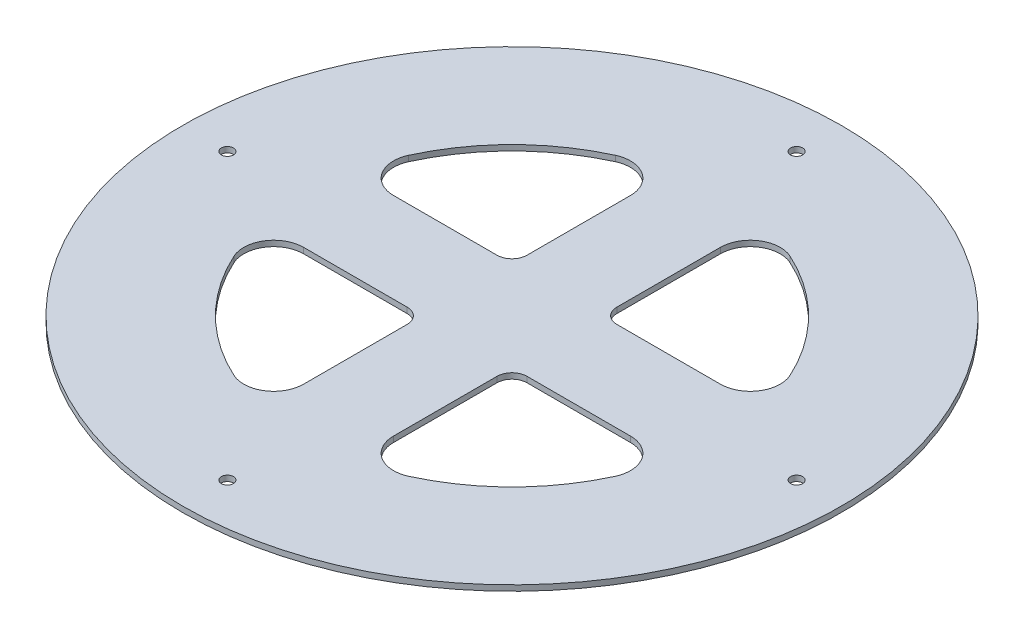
ISO-10303-21;
HEADER;
FILE_DESCRIPTION(('STEP AP214'),'2;1');
FILE_NAME('part.step','',(''),(''),'','','');
FILE_SCHEMA(('AUTOMOTIVE_DESIGN { 1 0 10303 214 1 1 1 1 }'));
ENDSEC;
DATA;
#1=APPLICATION_CONTEXT('core data for automotive mechanical design processes');
#2=APPLICATION_PROTOCOL_DEFINITION('international standard','automotive_design',2000,#1);
#3=PRODUCT_CONTEXT('',#1,'mechanical');
#4=PRODUCT('Part','Part','',(#3));
#5=PRODUCT_RELATED_PRODUCT_CATEGORY('part','',(#4));
#6=PRODUCT_DEFINITION_FORMATION('','',#4);
#7=PRODUCT_DEFINITION_CONTEXT('part definition',#1,'design');
#8=PRODUCT_DEFINITION('design','',#6,#7);
#9=PRODUCT_DEFINITION_SHAPE('','',#8);
#10=(LENGTH_UNIT() NAMED_UNIT(*) SI_UNIT(.MILLI.,.METRE.));
#11=(NAMED_UNIT(*) PLANE_ANGLE_UNIT() SI_UNIT($,.RADIAN.));
#12=(NAMED_UNIT(*) SI_UNIT($,.STERADIAN.) SOLID_ANGLE_UNIT());
#13=UNCERTAINTY_MEASURE_WITH_UNIT(LENGTH_MEASURE(1.E-05),#10,'distance_accuracy_value','');
#14=(GEOMETRIC_REPRESENTATION_CONTEXT(3) GLOBAL_UNCERTAINTY_ASSIGNED_CONTEXT((#13)) GLOBAL_UNIT_ASSIGNED_CONTEXT((#10,
#11,#12)) REPRESENTATION_CONTEXT('',''));
#15=CARTESIAN_POINT('',(0.,0.,0.));
#16=DIRECTION('',(0.,0.,1.));
#17=DIRECTION('',(1.,0.,0.));
#18=AXIS2_PLACEMENT_3D('',#15,#16,#17);
#19=CARTESIAN_POINT('',(0.,-9.525,0.));
#20=DIRECTION('',(0.,1.,0.));
#21=DIRECTION('',(0.,0.,1.));
#22=AXIS2_PLACEMENT_3D('',#19,#20,#21);
#23=CYLINDRICAL_SURFACE('',#22,558.8);
#24=CARTESIAN_POINT('',(0.,-9.525,0.));
#25=DIRECTION('',(0.,1.,0.));
#26=DIRECTION('',(0.,0.,1.));
#27=AXIS2_PLACEMENT_3D('',#24,#25,#26);
#28=CIRCLE('',#27,558.8);
#29=CARTESIAN_POINT('',(0.,-9.525,558.8));
#30=VERTEX_POINT('',#29);
#31=EDGE_CURVE('E11',#30,#30,#28,.T.);
#32=CARTESIAN_POINT('',(0.,0.,0.));
#33=DIRECTION('',(0.,1.,0.));
#34=DIRECTION('',(0.,0.,1.));
#35=AXIS2_PLACEMENT_3D('',#32,#33,#34);
#36=CIRCLE('',#35,558.8);
#37=CARTESIAN_POINT('',(0.,0.,558.8));
#38=VERTEX_POINT('',#37);
#39=EDGE_CURVE('E38',#38,#38,#36,.T.);
#40=CARTESIAN_POINT('',(0.,-9.525,558.8));
#41=CARTESIAN_POINT('',(0.,-9.42578125,558.8));
#42=CARTESIAN_POINT('',(0.,-9.3265625,558.8));
#43=CARTESIAN_POINT('',(0.,-9.128125,558.8));
#44=CARTESIAN_POINT('',(0.,-9.02890625,558.8));
#45=CARTESIAN_POINT('',(0.,-8.83046875,558.8));
#46=CARTESIAN_POINT('',(0.,-8.73125,558.8));
#47=CARTESIAN_POINT('',(0.,-8.5328125,558.8));
#48=CARTESIAN_POINT('',(0.,-8.43359375,558.8));
#49=CARTESIAN_POINT('',(0.,-8.23515625,558.8));
#50=CARTESIAN_POINT('',(0.,-8.1359375,558.8));
#51=CARTESIAN_POINT('',(0.,-7.9375,558.8));
#52=CARTESIAN_POINT('',(0.,-7.83828125,558.8));
#53=CARTESIAN_POINT('',(0.,-7.63984375,558.8));
#54=CARTESIAN_POINT('',(0.,-7.540625,558.8));
#55=CARTESIAN_POINT('',(0.,-7.3421875,558.8));
#56=CARTESIAN_POINT('',(0.,-7.24296875,558.8));
#57=CARTESIAN_POINT('',(0.,-7.04453125,558.8));
#58=CARTESIAN_POINT('',(0.,-6.9453125,558.8));
#59=CARTESIAN_POINT('',(0.,-6.746875,558.8));
#60=CARTESIAN_POINT('',(0.,-6.64765625,558.8));
#61=CARTESIAN_POINT('',(0.,-6.44921875,558.8));
#62=CARTESIAN_POINT('',(0.,-6.35,558.8));
#63=CARTESIAN_POINT('',(0.,-6.1515625,558.8));
#64=CARTESIAN_POINT('',(0.,-6.05234375,558.8));
#65=CARTESIAN_POINT('',(0.,-5.85390625,558.8));
#66=CARTESIAN_POINT('',(0.,-5.7546875,558.8));
#67=CARTESIAN_POINT('',(0.,-5.55625,558.8));
#68=CARTESIAN_POINT('',(0.,-5.45703125,558.8));
#69=CARTESIAN_POINT('',(0.,-5.25859375,558.8));
#70=CARTESIAN_POINT('',(0.,-5.159375,558.8));
#71=CARTESIAN_POINT('',(0.,-4.9609375,558.8));
#72=CARTESIAN_POINT('',(0.,-4.86171875,558.8));
#73=CARTESIAN_POINT('',(0.,-4.66328125,558.8));
#74=CARTESIAN_POINT('',(0.,-4.5640625,558.8));
#75=CARTESIAN_POINT('',(0.,-4.365625,558.8));
#76=CARTESIAN_POINT('',(0.,-4.26640625,558.8));
#77=CARTESIAN_POINT('',(0.,-4.06796875,558.8));
#78=CARTESIAN_POINT('',(0.,-3.96875,558.8));
#79=CARTESIAN_POINT('',(0.,-3.7703125,558.8));
#80=CARTESIAN_POINT('',(0.,-3.67109375,558.8));
#81=CARTESIAN_POINT('',(0.,-3.47265625,558.8));
#82=CARTESIAN_POINT('',(0.,-3.3734375,558.8));
#83=CARTESIAN_POINT('',(0.,-3.175,558.8));
#84=CARTESIAN_POINT('',(0.,-3.07578125,558.8));
#85=CARTESIAN_POINT('',(0.,-2.87734375,558.8));
#86=CARTESIAN_POINT('',(0.,-2.778125,558.8));
#87=CARTESIAN_POINT('',(0.,-2.5796875,558.8));
#88=CARTESIAN_POINT('',(0.,-2.48046875,558.8));
#89=CARTESIAN_POINT('',(0.,-2.28203125,558.8));
#90=CARTESIAN_POINT('',(0.,-2.1828125,558.8));
#91=CARTESIAN_POINT('',(0.,-1.984375,558.8));
#92=CARTESIAN_POINT('',(0.,-1.88515625,558.8));
#93=CARTESIAN_POINT('',(0.,-1.68671875,558.8));
#94=CARTESIAN_POINT('',(0.,-1.5875,558.8));
#95=CARTESIAN_POINT('',(0.,-1.3890625,558.8));
#96=CARTESIAN_POINT('',(0.,-1.28984375,558.8));
#97=CARTESIAN_POINT('',(0.,-1.09140625,558.8));
#98=CARTESIAN_POINT('',(0.,-0.992187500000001,558.8));
#99=CARTESIAN_POINT('',(0.,-0.793750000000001,558.8));
#100=CARTESIAN_POINT('',(0.,-0.69453125,558.8));
#101=CARTESIAN_POINT('',(0.,-0.49609375,558.8));
#102=CARTESIAN_POINT('',(0.,-0.396875,558.8));
#103=CARTESIAN_POINT('',(0.,-0.1984375,558.8));
#104=CARTESIAN_POINT('',(0.,-0.0992187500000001,558.8));
#105=CARTESIAN_POINT('',(0.,0.,558.8));
#106=B_SPLINE_CURVE_WITH_KNOTS('',3,(#40,#41,#42,#43,#44,#45,#46,#47,#48,#49,#50,#51,#52,#53,
#54,#55,#56,#57,#58,#59,#60,#61,#62,#63,#64,#65,#66,#67,#68,#69,#70,#71,#72,#73,#74,#75,#76,#77,
#78,#79,#80,#81,#82,#83,#84,#85,#86,#87,#88,#89,#90,#91,#92,#93,#94,#95,#96,#97,#98,#99,#100,
#101,#102,#103,#104,#105),.UNSPECIFIED.,.F.,.F.,(4,2,2,2,2,2,2,2,2,2,2,2,2,2,2,2,2,2,2,2,2,2,2,
2,2,2,2,2,2,2,2,2,4),(0.,0.297656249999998,0.595312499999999,0.892968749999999,1.190625,
1.48828125,1.7859375,2.08359375,2.38125,2.67890625,2.9765625,3.27421875,3.571875,3.86953125,
4.1671875,4.46484375,4.7625,5.06015625,5.3578125,5.65546875,5.953125,6.25078125,6.5484375,
6.84609375,7.14375,7.44140625,7.7390625,8.03671875,8.334375,8.63203125,8.9296875,9.22734375,
9.525),.UNSPECIFIED.);
#107=EDGE_CURVE('BSEAM31',#30,#38,#106,.T.);
#108=ORIENTED_EDGE('',*,*,#31,.T.);
#109=ORIENTED_EDGE('',*,*,#39,.F.);
#110=ORIENTED_EDGE('',*,*,#107,.T.);
#111=ORIENTED_EDGE('',*,*,#107,.F.);
#112=EDGE_LOOP('',(#108,#110,#109,#111));
#113=FACE_BOUND('',#112,.T.);
#114=ADVANCED_FACE('F31',(#113),#23,.T.);
#115=CARTESIAN_POINT('',(0.,-9.525,0.));
#116=DIRECTION('',(0.,1.,0.));
#117=DIRECTION('',(0.,0.,1.));
#118=AXIS2_PLACEMENT_3D('',#115,#116,#117);
#119=PLANE('',#118);
#120=CARTESIAN_POINT('',(482.6,-9.525,-5.05496961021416E-12));
#121=DIRECTION('',(0.,1.,0.));
#122=DIRECTION('',(-1.,0.,0.));
#123=AXIS2_PLACEMENT_3D('',#120,#121,#122);
#124=CIRCLE('',#123,10.3124);
#125=CARTESIAN_POINT('',(482.6,-9.525,10.3123999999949));
#126=VERTEX_POINT('',#125);
#127=EDGE_CURVE('E518',#126,#126,#124,.T.);
#128=ORIENTED_EDGE('',*,*,#127,.T.);
#129=EDGE_LOOP('',(#128));
#130=FACE_BOUND('',#129,.T.);
#131=CARTESIAN_POINT('',(3.36997974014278E-12,-9.525,482.6));
#132=DIRECTION('',(0.,1.,0.));
#133=DIRECTION('',(0.,0.,-1.));
#134=AXIS2_PLACEMENT_3D('',#131,#132,#133);
#135=CIRCLE('',#134,10.3124);
#136=CARTESIAN_POINT('',(3.36997974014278E-12,-9.525,492.9124));
#137=VERTEX_POINT('',#136);
#138=EDGE_CURVE('E528',#137,#137,#135,.T.);
#139=ORIENTED_EDGE('',*,*,#138,.T.);
#140=EDGE_LOOP('',(#139));
#141=FACE_BOUND('',#140,.T.);
#142=CARTESIAN_POINT('',(-482.6,-9.525,1.68498987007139E-12));
#143=DIRECTION('',(0.,1.,0.));
#144=DIRECTION('',(1.,0.,0.));
#145=AXIS2_PLACEMENT_3D('',#142,#143,#144);
#146=CIRCLE('',#145,10.3124);
#147=CARTESIAN_POINT('',(-482.6,-9.525,10.3124000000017));
#148=VERTEX_POINT('',#147);
#149=EDGE_CURVE('E534',#148,#148,#146,.T.);
#150=ORIENTED_EDGE('',*,*,#149,.T.);
#151=EDGE_LOOP('',(#150));
#152=FACE_BOUND('',#151,.T.);
#153=CARTESIAN_POINT('',(0.,-9.525,-482.6));
#154=DIRECTION('',(0.,1.,0.));
#155=DIRECTION('',(0.,0.,1.));
#156=AXIS2_PLACEMENT_3D('',#153,#154,#155);
#157=CIRCLE('',#156,10.3124);
#158=CARTESIAN_POINT('',(0.,-9.525,-472.2876));
#159=VERTEX_POINT('',#158);
#160=EDGE_CURVE('E540',#159,#159,#157,.T.);
#161=ORIENTED_EDGE('',*,*,#160,.T.);
#162=EDGE_LOOP('',(#161));
#163=FACE_BOUND('',#162,.T.);
#164=CARTESIAN_POINT('',(0.,-9.525,0.));
#165=DIRECTION('',(0.,1.,0.));
#166=DIRECTION('',(0.,0.,1.));
#167=AXIS2_PLACEMENT_3D('',#164,#165,#166);
#168=CIRCLE('',#167,355.6);
#169=CARTESIAN_POINT('',(-323.261502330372,-9.525,148.166666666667));
#170=VERTEX_POINT('',#169);
#171=CARTESIAN_POINT('',(-148.166666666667,-9.525,323.261502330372));
#172=VERTEX_POINT('',#171);
#173=EDGE_CURVE('E233',#170,#172,#168,.T.);
#174=ORIENTED_EDGE('',*,*,#173,.T.);
#175=CARTESIAN_POINT('',(-127.,-9.525,277.081287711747));
#176=DIRECTION('',(0.,1.,0.));
#177=DIRECTION('',(0.,0.,1.));
#178=AXIS2_PLACEMENT_3D('',#175,#176,#177);
#179=CIRCLE('',#178,50.8);
#180=CARTESIAN_POINT('',(-76.2,-9.525,277.081287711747));
#181=VERTEX_POINT('',#180);
#182=EDGE_CURVE('E221',#172,#181,#179,.T.);
#183=ORIENTED_EDGE('',*,*,#182,.T.);
#184=DIRECTION('',(0.,0.,-1.));
#185=VECTOR('',#184,1.);
#186=CARTESIAN_POINT('',(-76.2,-9.525,101.6));
#187=LINE('',#186,#185);
#188=CARTESIAN_POINT('',(-76.2,-9.525,101.6));
#189=VERTEX_POINT('',#188);
#190=EDGE_CURVE('E224',#181,#189,#187,.T.);
#191=ORIENTED_EDGE('',*,*,#190,.T.);
#192=CARTESIAN_POINT('',(-101.6,-9.525,101.6));
#193=DIRECTION('',(0.,1.,0.));
#194=DIRECTION('',(0.,0.,1.));
#195=AXIS2_PLACEMENT_3D('',#192,#193,#194);
#196=CIRCLE('',#195,25.4);
#197=CARTESIAN_POINT('',(-101.6,-9.525,76.1999999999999));
#198=VERTEX_POINT('',#197);
#199=EDGE_CURVE('E45',#189,#198,#196,.T.);
#200=ORIENTED_EDGE('',*,*,#199,.T.);
#201=DIRECTION('',(-1.,0.,0.));
#202=VECTOR('',#201,1.);
#203=CARTESIAN_POINT('',(-277.081287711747,-9.525,76.2));
#204=LINE('',#203,#202);
#205=CARTESIAN_POINT('',(-277.081287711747,-9.525,76.1999999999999));
#206=VERTEX_POINT('',#205);
#207=EDGE_CURVE('E227',#198,#206,#204,.T.);
#208=ORIENTED_EDGE('',*,*,#207,.T.);
#209=CARTESIAN_POINT('',(-277.081287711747,-9.525,127.));
#210=DIRECTION('',(0.,1.,0.));
#211=DIRECTION('',(0.,0.,1.));
#212=AXIS2_PLACEMENT_3D('',#209,#210,#211);
#213=CIRCLE('',#212,50.8);
#214=EDGE_CURVE('E230',#206,#170,#213,.T.);
#215=ORIENTED_EDGE('',*,*,#214,.T.);
#216=EDGE_LOOP('',(#174,#183,#191,#200,#208,#215));
#217=FACE_BOUND('',#216,.T.);
#218=CARTESIAN_POINT('',(0.,-9.525,0.));
#219=DIRECTION('',(0.,1.,0.));
#220=DIRECTION('',(0.,0.,1.));
#221=AXIS2_PLACEMENT_3D('',#218,#219,#220);
#222=CIRCLE('',#221,355.6);
#223=CARTESIAN_POINT('',(148.166666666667,-9.525,323.261502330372));
#224=VERTEX_POINT('',#223);
#225=CARTESIAN_POINT('',(323.261502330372,-9.525,148.166666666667));
#226=VERTEX_POINT('',#225);
#227=EDGE_CURVE('E276',#224,#226,#222,.T.);
#228=ORIENTED_EDGE('',*,*,#227,.T.);
#229=CARTESIAN_POINT('',(277.081287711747,-9.525,127.));
#230=DIRECTION('',(0.,1.,0.));
#231=DIRECTION('',(0.,0.,1.));
#232=AXIS2_PLACEMENT_3D('',#229,#230,#231);
#233=CIRCLE('',#232,50.8);
#234=CARTESIAN_POINT('',(277.081287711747,-9.525,76.2));
#235=VERTEX_POINT('',#234);
#236=EDGE_CURVE('E261',#226,#235,#233,.T.);
#237=ORIENTED_EDGE('',*,*,#236,.T.);
#238=DIRECTION('',(-1.,0.,0.));
#239=VECTOR('',#238,1.);
#240=CARTESIAN_POINT('',(101.6,-9.525,76.1999999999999));
#241=LINE('',#240,#239);
#242=CARTESIAN_POINT('',(101.6,-9.525,76.1999999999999));
#243=VERTEX_POINT('',#242);
#244=EDGE_CURVE('E264',#235,#243,#241,.T.);
#245=ORIENTED_EDGE('',*,*,#244,.T.);
#246=CARTESIAN_POINT('',(101.6,-9.525,101.6));
#247=DIRECTION('',(0.,1.,0.));
#248=DIRECTION('',(0.,0.,-1.));
#249=AXIS2_PLACEMENT_3D('',#246,#247,#248);
#250=CIRCLE('',#249,25.4);
#251=CARTESIAN_POINT('',(76.2,-9.525,101.6));
#252=VERTEX_POINT('',#251);
#253=EDGE_CURVE('E267',#243,#252,#250,.T.);
#254=ORIENTED_EDGE('',*,*,#253,.T.);
#255=DIRECTION('',(0.,0.,1.));
#256=VECTOR('',#255,1.);
#257=CARTESIAN_POINT('',(76.2,-9.525,101.6));
#258=LINE('',#257,#256);
#259=CARTESIAN_POINT('',(76.2000000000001,-9.525,277.081287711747));
#260=VERTEX_POINT('',#259);
#261=EDGE_CURVE('E270',#252,#260,#258,.T.);
#262=ORIENTED_EDGE('',*,*,#261,.T.);
#263=CARTESIAN_POINT('',(127.,-9.525,277.081287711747));
#264=DIRECTION('',(0.,1.,0.));
#265=DIRECTION('',(0.,0.,1.));
#266=AXIS2_PLACEMENT_3D('',#263,#264,#265);
#267=CIRCLE('',#266,50.8);
#268=EDGE_CURVE('E273',#260,#224,#267,.T.);
#269=ORIENTED_EDGE('',*,*,#268,.T.);
#270=EDGE_LOOP('',(#228,#237,#245,#254,#262,#269));
#271=FACE_BOUND('',#270,.T.);
#272=CARTESIAN_POINT('',(0.,-9.525,0.));
#273=DIRECTION('',(0.,1.,0.));
#274=DIRECTION('',(0.,0.,1.));
#275=AXIS2_PLACEMENT_3D('',#272,#273,#274);
#276=CIRCLE('',#275,355.6);
#277=CARTESIAN_POINT('',(323.261502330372,-9.525,-148.166666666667));
#278=VERTEX_POINT('',#277);
#279=CARTESIAN_POINT('',(148.166666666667,-9.525,-323.261502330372));
#280=VERTEX_POINT('',#279);
#281=EDGE_CURVE('E324',#278,#280,#276,.T.);
#282=ORIENTED_EDGE('',*,*,#281,.T.);
#283=CARTESIAN_POINT('',(127.,-9.525,-277.081287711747));
#284=DIRECTION('',(0.,1.,0.));
#285=DIRECTION('',(0.,0.,-1.));
#286=AXIS2_PLACEMENT_3D('',#283,#284,#285);
#287=CIRCLE('',#286,50.8);
#288=CARTESIAN_POINT('',(76.1999999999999,-9.525,-277.081287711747));
#289=VERTEX_POINT('',#288);
#290=EDGE_CURVE('E309',#280,#289,#287,.T.);
#291=ORIENTED_EDGE('',*,*,#290,.T.);
#292=DIRECTION('',(0.,0.,1.));
#293=VECTOR('',#292,1.);
#294=CARTESIAN_POINT('',(76.1999999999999,-9.525,-277.081287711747));
#295=LINE('',#294,#293);
#296=CARTESIAN_POINT('',(76.1999999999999,-9.525,-101.6));
#297=VERTEX_POINT('',#296);
#298=EDGE_CURVE('E312',#289,#297,#295,.T.);
#299=ORIENTED_EDGE('',*,*,#298,.T.);
#300=CARTESIAN_POINT('',(101.6,-9.525,-101.6));
#301=DIRECTION('',(0.,1.,0.));
#302=DIRECTION('',(0.,0.,-1.));
#303=AXIS2_PLACEMENT_3D('',#300,#301,#302);
#304=CIRCLE('',#303,25.4);
#305=CARTESIAN_POINT('',(101.6,-9.525,-76.2));
#306=VERTEX_POINT('',#305);
#307=EDGE_CURVE('E315',#297,#306,#304,.T.);
#308=ORIENTED_EDGE('',*,*,#307,.T.);
#309=DIRECTION('',(1.,0.,0.));
#310=VECTOR('',#309,1.);
#311=CARTESIAN_POINT('',(101.6,-9.525,-76.2));
#312=LINE('',#311,#310);
#313=CARTESIAN_POINT('',(277.081287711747,-9.525,-76.2));
#314=VERTEX_POINT('',#313);
#315=EDGE_CURVE('E318',#306,#314,#312,.T.);
#316=ORIENTED_EDGE('',*,*,#315,.T.);
#317=CARTESIAN_POINT('',(277.081287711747,-9.525,-127.));
#318=DIRECTION('',(0.,1.,0.));
#319=DIRECTION('',(0.,0.,1.));
#320=AXIS2_PLACEMENT_3D('',#317,#318,#319);
#321=CIRCLE('',#320,50.8);
#322=EDGE_CURVE('E321',#314,#278,#321,.T.);
#323=ORIENTED_EDGE('',*,*,#322,.T.);
#324=EDGE_LOOP('',(#282,#291,#299,#308,#316,#323));
#325=FACE_BOUND('',#324,.T.);
#326=DIRECTION('',(0.,0.,-1.));
#327=VECTOR('',#326,1.);
#328=CARTESIAN_POINT('',(-76.2,-9.525,-277.081287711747));
#329=LINE('',#328,#327);
#330=CARTESIAN_POINT('',(-76.2,-9.525,-101.6));
#331=VERTEX_POINT('',#330);
#332=CARTESIAN_POINT('',(-76.2,-9.525,-277.081287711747));
#333=VERTEX_POINT('',#332);
#334=EDGE_CURVE('E372',#331,#333,#329,.T.);
#335=ORIENTED_EDGE('',*,*,#334,.T.);
#336=CARTESIAN_POINT('',(-127.,-9.525,-277.081287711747));
#337=DIRECTION('',(0.,1.,0.));
#338=DIRECTION('',(0.,0.,-1.));
#339=AXIS2_PLACEMENT_3D('',#336,#337,#338);
#340=CIRCLE('',#339,50.8);
#341=CARTESIAN_POINT('',(-148.166666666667,-9.525,-323.261502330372));
#342=VERTEX_POINT('',#341);
#343=EDGE_CURVE('E357',#333,#342,#340,.T.);
#344=ORIENTED_EDGE('',*,*,#343,.T.);
#345=CARTESIAN_POINT('',(0.,-9.525,0.));
#346=DIRECTION('',(0.,1.,0.));
#347=DIRECTION('',(0.,0.,1.));
#348=AXIS2_PLACEMENT_3D('',#345,#346,#347);
#349=CIRCLE('',#348,355.6);
#350=CARTESIAN_POINT('',(-323.261502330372,-9.525,-148.166666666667));
#351=VERTEX_POINT('',#350);
#352=EDGE_CURVE('E360',#342,#351,#349,.T.);
#353=ORIENTED_EDGE('',*,*,#352,.T.);
#354=CARTESIAN_POINT('',(-277.081287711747,-9.525,-127.));
#355=DIRECTION('',(0.,1.,0.));
#356=DIRECTION('',(0.,0.,-1.));
#357=AXIS2_PLACEMENT_3D('',#354,#355,#356);
#358=CIRCLE('',#357,50.8);
#359=CARTESIAN_POINT('',(-277.081287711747,-9.525,-76.2));
#360=VERTEX_POINT('',#359);
#361=EDGE_CURVE('E363',#351,#360,#358,.T.);
#362=ORIENTED_EDGE('',*,*,#361,.T.);
#363=DIRECTION('',(1.,0.,0.));
#364=VECTOR('',#363,1.);
#365=CARTESIAN_POINT('',(-277.081287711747,-9.525,-76.2));
#366=LINE('',#365,#364);
#367=CARTESIAN_POINT('',(-101.6,-9.525,-76.2));
#368=VERTEX_POINT('',#367);
#369=EDGE_CURVE('E366',#360,#368,#366,.T.);
#370=ORIENTED_EDGE('',*,*,#369,.T.);
#371=CARTESIAN_POINT('',(-101.6,-9.525,-101.6));
#372=DIRECTION('',(0.,1.,0.));
#373=DIRECTION('',(0.,0.,1.));
#374=AXIS2_PLACEMENT_3D('',#371,#372,#373);
#375=CIRCLE('',#374,25.4);
#376=EDGE_CURVE('E369',#368,#331,#375,.T.);
#377=ORIENTED_EDGE('',*,*,#376,.T.);
#378=EDGE_LOOP('',(#335,#344,#353,#362,#370,#377));
#379=FACE_BOUND('',#378,.T.);
#380=ORIENTED_EDGE('',*,*,#31,.F.);
#381=EDGE_LOOP('',(#380));
#382=FACE_BOUND('',#381,.T.);
#383=ADVANCED_FACE('F392',(#130,#141,#152,#163,#217,#271,#325,#379,#382),#119,.F.);
#384=CARTESIAN_POINT('',(0.,0.,0.));
#385=DIRECTION('',(0.,1.,0.));
#386=DIRECTION('',(0.,0.,1.));
#387=AXIS2_PLACEMENT_3D('',#384,#385,#386);
#388=PLANE('',#387);
#389=CARTESIAN_POINT('',(482.6,0.,-5.05496961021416E-12));
#390=DIRECTION('',(0.,1.,0.));
#391=DIRECTION('',(-1.,0.,0.));
#392=AXIS2_PLACEMENT_3D('',#389,#390,#391);
#393=CIRCLE('',#392,10.3124);
#394=CARTESIAN_POINT('',(482.6,0.,10.3123999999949));
#395=VERTEX_POINT('',#394);
#396=EDGE_CURVE('E521',#395,#395,#393,.T.);
#397=ORIENTED_EDGE('',*,*,#396,.F.);
#398=EDGE_LOOP('',(#397));
#399=FACE_BOUND('',#398,.T.);
#400=CARTESIAN_POINT('',(3.36997974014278E-12,0.,482.6));
#401=DIRECTION('',(0.,1.,0.));
#402=DIRECTION('',(0.,0.,-1.));
#403=AXIS2_PLACEMENT_3D('',#400,#401,#402);
#404=CIRCLE('',#403,10.3124);
#405=CARTESIAN_POINT('',(3.36997974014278E-12,0.,492.9124));
#406=VERTEX_POINT('',#405);
#407=EDGE_CURVE('E523',#406,#406,#404,.T.);
#408=ORIENTED_EDGE('',*,*,#407,.F.);
#409=EDGE_LOOP('',(#408));
#410=FACE_BOUND('',#409,.T.);
#411=CARTESIAN_POINT('',(-482.6,0.,1.68498987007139E-12));
#412=DIRECTION('',(0.,1.,0.));
#413=DIRECTION('',(1.,0.,0.));
#414=AXIS2_PLACEMENT_3D('',#411,#412,#413);
#415=CIRCLE('',#414,10.3124);
#416=CARTESIAN_POINT('',(-482.6,0.,10.3124000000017));
#417=VERTEX_POINT('',#416);
#418=EDGE_CURVE('E531',#417,#417,#415,.T.);
#419=ORIENTED_EDGE('',*,*,#418,.F.);
#420=EDGE_LOOP('',(#419));
#421=FACE_BOUND('',#420,.T.);
#422=CARTESIAN_POINT('',(0.,0.,-482.6));
#423=DIRECTION('',(0.,1.,0.));
#424=DIRECTION('',(0.,0.,1.));
#425=AXIS2_PLACEMENT_3D('',#422,#423,#424);
#426=CIRCLE('',#425,10.3124);
#427=CARTESIAN_POINT('',(0.,0.,-472.2876));
#428=VERTEX_POINT('',#427);
#429=EDGE_CURVE('E537',#428,#428,#426,.T.);
#430=ORIENTED_EDGE('',*,*,#429,.F.);
#431=EDGE_LOOP('',(#430));
#432=FACE_BOUND('',#431,.T.);
#433=CARTESIAN_POINT('',(-127.,0.,277.081287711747));
#434=DIRECTION('',(0.,1.,0.));
#435=DIRECTION('',(0.,0.,1.));
#436=AXIS2_PLACEMENT_3D('',#433,#434,#435);
#437=CIRCLE('',#436,50.8);
#438=CARTESIAN_POINT('',(-148.166666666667,0.,323.261502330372));
#439=VERTEX_POINT('',#438);
#440=CARTESIAN_POINT('',(-76.2,0.,277.081287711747));
#441=VERTEX_POINT('',#440);
#442=EDGE_CURVE('E53',#439,#441,#437,.T.);
#443=ORIENTED_EDGE('',*,*,#442,.F.);
#444=CARTESIAN_POINT('',(0.,0.,0.));
#445=DIRECTION('',(0.,1.,0.));
#446=DIRECTION('',(0.,0.,1.));
#447=AXIS2_PLACEMENT_3D('',#444,#445,#446);
#448=CIRCLE('',#447,355.6);
#449=CARTESIAN_POINT('',(-323.261502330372,0.,148.166666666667));
#450=VERTEX_POINT('',#449);
#451=EDGE_CURVE('E218',#450,#439,#448,.T.);
#452=ORIENTED_EDGE('',*,*,#451,.F.);
#453=CARTESIAN_POINT('',(-277.081287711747,0.,127.));
#454=DIRECTION('',(0.,1.,0.));
#455=DIRECTION('',(0.,0.,1.));
#456=AXIS2_PLACEMENT_3D('',#453,#454,#455);
#457=CIRCLE('',#456,50.8);
#458=CARTESIAN_POINT('',(-277.081287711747,0.,76.1999999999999));
#459=VERTEX_POINT('',#458);
#460=EDGE_CURVE('E212',#459,#450,#457,.T.);
#461=ORIENTED_EDGE('',*,*,#460,.F.);
#462=DIRECTION('',(-1.,0.,0.));
#463=VECTOR('',#462,1.);
#464=CARTESIAN_POINT('',(-277.081287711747,0.,76.2));
#465=LINE('',#464,#463);
#466=CARTESIAN_POINT('',(-101.6,0.,76.1999999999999));
#467=VERTEX_POINT('',#466);
#468=EDGE_CURVE('E210',#467,#459,#465,.T.);
#469=ORIENTED_EDGE('',*,*,#468,.F.);
#470=CARTESIAN_POINT('',(-101.6,0.,101.6));
#471=DIRECTION('',(0.,1.,0.));
#472=DIRECTION('',(0.,0.,1.));
#473=AXIS2_PLACEMENT_3D('',#470,#471,#472);
#474=CIRCLE('',#473,25.4);
#475=CARTESIAN_POINT('',(-76.2,0.,101.6));
#476=VERTEX_POINT('',#475);
#477=EDGE_CURVE('E193',#476,#467,#474,.T.);
#478=ORIENTED_EDGE('',*,*,#477,.F.);
#479=DIRECTION('',(0.,0.,-1.));
#480=VECTOR('',#479,1.);
#481=CARTESIAN_POINT('',(-76.2,0.,101.6));
#482=LINE('',#481,#480);
#483=EDGE_CURVE('E202',#441,#476,#482,.T.);
#484=ORIENTED_EDGE('',*,*,#483,.F.);
#485=EDGE_LOOP('',(#443,#452,#461,#469,#478,#484));
#486=FACE_BOUND('',#485,.T.);
#487=CARTESIAN_POINT('',(277.081287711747,0.,127.));
#488=DIRECTION('',(0.,1.,0.));
#489=DIRECTION('',(0.,0.,1.));
#490=AXIS2_PLACEMENT_3D('',#487,#488,#489);
#491=CIRCLE('',#490,50.8);
#492=CARTESIAN_POINT('',(323.261502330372,0.,148.166666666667));
#493=VERTEX_POINT('',#492);
#494=CARTESIAN_POINT('',(277.081287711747,0.,76.2));
#495=VERTEX_POINT('',#494);
#496=EDGE_CURVE('E238',#493,#495,#491,.T.);
#497=ORIENTED_EDGE('',*,*,#496,.F.);
#498=CARTESIAN_POINT('',(0.,0.,0.));
#499=DIRECTION('',(0.,1.,0.));
#500=DIRECTION('',(0.,0.,1.));
#501=AXIS2_PLACEMENT_3D('',#498,#499,#500);
#502=CIRCLE('',#501,355.6);
#503=CARTESIAN_POINT('',(148.166666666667,0.,323.261502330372));
#504=VERTEX_POINT('',#503);
#505=EDGE_CURVE('E258',#504,#493,#502,.T.);
#506=ORIENTED_EDGE('',*,*,#505,.F.);
#507=CARTESIAN_POINT('',(127.,0.,277.081287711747));
#508=DIRECTION('',(0.,1.,0.));
#509=DIRECTION('',(0.,0.,1.));
#510=AXIS2_PLACEMENT_3D('',#507,#508,#509);
#511=CIRCLE('',#510,50.8);
#512=CARTESIAN_POINT('',(76.2000000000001,0.,277.081287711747));
#513=VERTEX_POINT('',#512);
#514=EDGE_CURVE('E255',#513,#504,#511,.T.);
#515=ORIENTED_EDGE('',*,*,#514,.F.);
#516=DIRECTION('',(0.,0.,1.));
#517=VECTOR('',#516,1.);
#518=CARTESIAN_POINT('',(76.2,0.,101.6));
#519=LINE('',#518,#517);
#520=CARTESIAN_POINT('',(76.2,0.,101.6));
#521=VERTEX_POINT('',#520);
#522=EDGE_CURVE('E252',#521,#513,#519,.T.);
#523=ORIENTED_EDGE('',*,*,#522,.F.);
#524=CARTESIAN_POINT('',(101.6,0.,101.6));
#525=DIRECTION('',(0.,1.,0.));
#526=DIRECTION('',(0.,0.,-1.));
#527=AXIS2_PLACEMENT_3D('',#524,#525,#526);
#528=CIRCLE('',#527,25.4);
#529=CARTESIAN_POINT('',(101.6,0.,76.1999999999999));
#530=VERTEX_POINT('',#529);
#531=EDGE_CURVE('E249',#530,#521,#528,.T.);
#532=ORIENTED_EDGE('',*,*,#531,.F.);
#533=DIRECTION('',(-1.,0.,0.));
#534=VECTOR('',#533,1.);
#535=CARTESIAN_POINT('',(101.6,0.,76.1999999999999));
#536=LINE('',#535,#534);
#537=EDGE_CURVE('E246',#495,#530,#536,.T.);
#538=ORIENTED_EDGE('',*,*,#537,.F.);
#539=EDGE_LOOP('',(#497,#506,#515,#523,#532,#538));
#540=FACE_BOUND('',#539,.T.);
#541=CARTESIAN_POINT('',(127.,0.,-277.081287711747));
#542=DIRECTION('',(0.,1.,0.));
#543=DIRECTION('',(0.,0.,-1.));
#544=AXIS2_PLACEMENT_3D('',#541,#542,#543);
#545=CIRCLE('',#544,50.8);
#546=CARTESIAN_POINT('',(148.166666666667,0.,-323.261502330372));
#547=VERTEX_POINT('',#546);
#548=CARTESIAN_POINT('',(76.1999999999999,0.,-277.081287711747));
#549=VERTEX_POINT('',#548);
#550=EDGE_CURVE('E282',#547,#549,#545,.T.);
#551=ORIENTED_EDGE('',*,*,#550,.F.);
#552=CARTESIAN_POINT('',(0.,0.,0.));
#553=DIRECTION('',(0.,1.,0.));
#554=DIRECTION('',(0.,0.,1.));
#555=AXIS2_PLACEMENT_3D('',#552,#553,#554);
#556=CIRCLE('',#555,355.6);
#557=CARTESIAN_POINT('',(323.261502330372,0.,-148.166666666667));
#558=VERTEX_POINT('',#557);
#559=EDGE_CURVE('E306',#558,#547,#556,.T.);
#560=ORIENTED_EDGE('',*,*,#559,.F.);
#561=CARTESIAN_POINT('',(277.081287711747,0.,-127.));
#562=DIRECTION('',(0.,1.,0.));
#563=DIRECTION('',(0.,0.,1.));
#564=AXIS2_PLACEMENT_3D('',#561,#562,#563);
#565=CIRCLE('',#564,50.8);
#566=CARTESIAN_POINT('',(277.081287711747,0.,-76.2));
#567=VERTEX_POINT('',#566);
#568=EDGE_CURVE('E303',#567,#558,#565,.T.);
#569=ORIENTED_EDGE('',*,*,#568,.F.);
#570=DIRECTION('',(1.,0.,0.));
#571=VECTOR('',#570,1.);
#572=CARTESIAN_POINT('',(101.6,0.,-76.2));
#573=LINE('',#572,#571);
#574=CARTESIAN_POINT('',(101.6,0.,-76.2));
#575=VERTEX_POINT('',#574);
#576=EDGE_CURVE('E300',#575,#567,#573,.T.);
#577=ORIENTED_EDGE('',*,*,#576,.F.);
#578=CARTESIAN_POINT('',(101.6,0.,-101.6));
#579=DIRECTION('',(0.,1.,0.));
#580=DIRECTION('',(0.,0.,-1.));
#581=AXIS2_PLACEMENT_3D('',#578,#579,#580);
#582=CIRCLE('',#581,25.4);
#583=CARTESIAN_POINT('',(76.1999999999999,0.,-101.6));
#584=VERTEX_POINT('',#583);
#585=EDGE_CURVE('E297',#584,#575,#582,.T.);
#586=ORIENTED_EDGE('',*,*,#585,.F.);
#587=DIRECTION('',(0.,0.,1.));
#588=VECTOR('',#587,1.);
#589=CARTESIAN_POINT('',(76.1999999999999,0.,-277.081287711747));
#590=LINE('',#589,#588);
#591=EDGE_CURVE('E294',#549,#584,#590,.T.);
#592=ORIENTED_EDGE('',*,*,#591,.F.);
#593=EDGE_LOOP('',(#551,#560,#569,#577,#586,#592));
#594=FACE_BOUND('',#593,.T.);
#595=CARTESIAN_POINT('',(-127.,0.,-277.081287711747));
#596=DIRECTION('',(0.,1.,0.));
#597=DIRECTION('',(0.,0.,-1.));
#598=AXIS2_PLACEMENT_3D('',#595,#596,#597);
#599=CIRCLE('',#598,50.8);
#600=CARTESIAN_POINT('',(-76.2,0.,-277.081287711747));
#601=VERTEX_POINT('',#600);
#602=CARTESIAN_POINT('',(-148.166666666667,0.,-323.261502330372));
#603=VERTEX_POINT('',#602);
#604=EDGE_CURVE('E330',#601,#603,#599,.T.);
#605=ORIENTED_EDGE('',*,*,#604,.F.);
#606=DIRECTION('',(0.,0.,-1.));
#607=VECTOR('',#606,1.);
#608=CARTESIAN_POINT('',(-76.2,0.,-277.081287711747));
#609=LINE('',#608,#607);
#610=CARTESIAN_POINT('',(-76.2,0.,-101.6));
#611=VERTEX_POINT('',#610);
#612=EDGE_CURVE('E354',#611,#601,#609,.T.);
#613=ORIENTED_EDGE('',*,*,#612,.F.);
#614=CARTESIAN_POINT('',(-101.6,0.,-101.6));
#615=DIRECTION('',(0.,1.,0.));
#616=DIRECTION('',(0.,0.,1.));
#617=AXIS2_PLACEMENT_3D('',#614,#615,#616);
#618=CIRCLE('',#617,25.4);
#619=CARTESIAN_POINT('',(-101.6,0.,-76.2));
#620=VERTEX_POINT('',#619);
#621=EDGE_CURVE('E351',#620,#611,#618,.T.);
#622=ORIENTED_EDGE('',*,*,#621,.F.);
#623=DIRECTION('',(1.,0.,0.));
#624=VECTOR('',#623,1.);
#625=CARTESIAN_POINT('',(-277.081287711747,0.,-76.2));
#626=LINE('',#625,#624);
#627=CARTESIAN_POINT('',(-277.081287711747,0.,-76.2));
#628=VERTEX_POINT('',#627);
#629=EDGE_CURVE('E348',#628,#620,#626,.T.);
#630=ORIENTED_EDGE('',*,*,#629,.F.);
#631=CARTESIAN_POINT('',(-277.081287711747,0.,-127.));
#632=DIRECTION('',(0.,1.,0.));
#633=DIRECTION('',(0.,0.,-1.));
#634=AXIS2_PLACEMENT_3D('',#631,#632,#633);
#635=CIRCLE('',#634,50.8);
#636=CARTESIAN_POINT('',(-323.261502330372,0.,-148.166666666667));
#637=VERTEX_POINT('',#636);
#638=EDGE_CURVE('E345',#637,#628,#635,.T.);
#639=ORIENTED_EDGE('',*,*,#638,.F.);
#640=CARTESIAN_POINT('',(0.,0.,0.));
#641=DIRECTION('',(0.,1.,0.));
#642=DIRECTION('',(0.,0.,1.));
#643=AXIS2_PLACEMENT_3D('',#640,#641,#642);
#644=CIRCLE('',#643,355.6);
#645=EDGE_CURVE('E342',#603,#637,#644,.T.);
#646=ORIENTED_EDGE('',*,*,#645,.F.);
#647=EDGE_LOOP('',(#605,#613,#622,#630,#639,#646));
#648=FACE_BOUND('',#647,.T.);
#649=ORIENTED_EDGE('',*,*,#39,.T.);
#650=EDGE_LOOP('',(#649));
#651=FACE_BOUND('',#650,.T.);
#652=ADVANCED_FACE('F206',(#399,#410,#421,#432,#486,#540,#594,#648,#651),#388,.T.);
#653=CARTESIAN_POINT('',(-127.,-9.525,-277.081287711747));
#654=DIRECTION('',(0.,1.,0.));
#655=DIRECTION('',(0.,0.,1.));
#656=AXIS2_PLACEMENT_3D('',#653,#654,#655);
#657=CYLINDRICAL_SURFACE('',#656,50.8);
#658=ORIENTED_EDGE('',*,*,#604,.T.);
#659=DIRECTION('',(0.,1.,0.));
#660=VECTOR('',#659,1.);
#661=CARTESIAN_POINT('',(-148.166666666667,-9.525,-323.261502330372));
#662=LINE('',#661,#660);
#663=EDGE_CURVE('E375',#342,#603,#662,.T.);
#664=ORIENTED_EDGE('',*,*,#663,.F.);
#665=ORIENTED_EDGE('',*,*,#343,.F.);
#666=DIRECTION('',(0.,1.,0.));
#667=VECTOR('',#666,1.);
#668=CARTESIAN_POINT('',(-76.2,-9.525,-277.081287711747));
#669=LINE('',#668,#667);
#670=EDGE_CURVE('E376',#333,#601,#669,.T.);
#671=ORIENTED_EDGE('',*,*,#670,.T.);
#672=EDGE_LOOP('',(#658,#664,#665,#671));
#673=FACE_BOUND('',#672,.T.);
#674=ADVANCED_FACE('F405',(#673),#657,.F.);
#675=CARTESIAN_POINT('',(-76.2,-9.525,-277.081287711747));
#676=DIRECTION('',(1.,0.,0.));
#677=DIRECTION('',(0.,0.,-1.));
#678=AXIS2_PLACEMENT_3D('',#675,#676,#677);
#679=PLANE('',#678);
#680=ORIENTED_EDGE('',*,*,#612,.T.);
#681=ORIENTED_EDGE('',*,*,#670,.F.);
#682=ORIENTED_EDGE('',*,*,#334,.F.);
#683=DIRECTION('',(0.,1.,0.));
#684=VECTOR('',#683,1.);
#685=CARTESIAN_POINT('',(-76.2,-9.525,-101.6));
#686=LINE('',#685,#684);
#687=EDGE_CURVE('E378',#331,#611,#686,.T.);
#688=ORIENTED_EDGE('',*,*,#687,.T.);
#689=EDGE_LOOP('',(#680,#681,#682,#688));
#690=FACE_BOUND('',#689,.T.);
#691=ADVANCED_FACE('F412',(#690),#679,.F.);
#692=CARTESIAN_POINT('',(-101.6,-9.525,-101.6));
#693=DIRECTION('',(0.,1.,0.));
#694=DIRECTION('',(0.,0.,1.));
#695=AXIS2_PLACEMENT_3D('',#692,#693,#694);
#696=CYLINDRICAL_SURFACE('',#695,25.4);
#697=ORIENTED_EDGE('',*,*,#621,.T.);
#698=ORIENTED_EDGE('',*,*,#687,.F.);
#699=ORIENTED_EDGE('',*,*,#376,.F.);
#700=DIRECTION('',(0.,1.,0.));
#701=VECTOR('',#700,1.);
#702=CARTESIAN_POINT('',(-101.6,-9.525,-76.2));
#703=LINE('',#702,#701);
#704=EDGE_CURVE('E380',#368,#620,#703,.T.);
#705=ORIENTED_EDGE('',*,*,#704,.T.);
#706=EDGE_LOOP('',(#697,#698,#699,#705));
#707=FACE_BOUND('',#706,.T.);
#708=ADVANCED_FACE('F426',(#707),#696,.F.);
#709=CARTESIAN_POINT('',(-277.081287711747,-9.525,-76.2));
#710=DIRECTION('',(0.,0.,1.));
#711=DIRECTION('',(1.,0.,0.));
#712=AXIS2_PLACEMENT_3D('',#709,#710,#711);
#713=PLANE('',#712);
#714=ORIENTED_EDGE('',*,*,#629,.T.);
#715=ORIENTED_EDGE('',*,*,#704,.F.);
#716=ORIENTED_EDGE('',*,*,#369,.F.);
#717=DIRECTION('',(0.,1.,0.));
#718=VECTOR('',#717,1.);
#719=CARTESIAN_POINT('',(-277.081287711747,-9.525,-76.2));
#720=LINE('',#719,#718);
#721=EDGE_CURVE('E382',#360,#628,#720,.T.);
#722=ORIENTED_EDGE('',*,*,#721,.T.);
#723=EDGE_LOOP('',(#714,#715,#716,#722));
#724=FACE_BOUND('',#723,.T.);
#725=ADVANCED_FACE('F422',(#724),#713,.F.);
#726=CARTESIAN_POINT('',(-277.081287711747,-9.525,-127.));
#727=DIRECTION('',(0.,1.,0.));
#728=DIRECTION('',(0.,0.,1.));
#729=AXIS2_PLACEMENT_3D('',#726,#727,#728);
#730=CYLINDRICAL_SURFACE('',#729,50.8);
#731=ORIENTED_EDGE('',*,*,#638,.T.);
#732=ORIENTED_EDGE('',*,*,#721,.F.);
#733=ORIENTED_EDGE('',*,*,#361,.F.);
#734=DIRECTION('',(0.,1.,0.));
#735=VECTOR('',#734,1.);
#736=CARTESIAN_POINT('',(-323.261502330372,-9.525,-148.166666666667));
#737=LINE('',#736,#735);
#738=EDGE_CURVE('E384',#351,#637,#737,.T.);
#739=ORIENTED_EDGE('',*,*,#738,.T.);
#740=EDGE_LOOP('',(#731,#732,#733,#739));
#741=FACE_BOUND('',#740,.T.);
#742=ADVANCED_FACE('F418',(#741),#730,.F.);
#743=CARTESIAN_POINT('',(0.,-9.525,0.));
#744=DIRECTION('',(0.,1.,0.));
#745=DIRECTION('',(0.,0.,1.));
#746=AXIS2_PLACEMENT_3D('',#743,#744,#745);
#747=CYLINDRICAL_SURFACE('',#746,355.6);
#748=ORIENTED_EDGE('',*,*,#645,.T.);
#749=ORIENTED_EDGE('',*,*,#738,.F.);
#750=ORIENTED_EDGE('',*,*,#352,.F.);
#751=ORIENTED_EDGE('',*,*,#663,.T.);
#752=EDGE_LOOP('',(#748,#749,#750,#751));
#753=FACE_BOUND('',#752,.T.);
#754=ADVANCED_FACE('F414',(#753),#747,.F.);
#755=CARTESIAN_POINT('',(127.,-9.525,-277.081287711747));
#756=DIRECTION('',(0.,1.,0.));
#757=DIRECTION('',(0.,0.,1.));
#758=AXIS2_PLACEMENT_3D('',#755,#756,#757);
#759=CYLINDRICAL_SURFACE('',#758,50.8);
#760=ORIENTED_EDGE('',*,*,#550,.T.);
#761=DIRECTION('',(0.,1.,0.));
#762=VECTOR('',#761,1.);
#763=CARTESIAN_POINT('',(76.1999999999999,-9.525,-277.081287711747));
#764=LINE('',#763,#762);
#765=EDGE_CURVE('E327',#289,#549,#764,.T.);
#766=ORIENTED_EDGE('',*,*,#765,.F.);
#767=ORIENTED_EDGE('',*,*,#290,.F.);
#768=DIRECTION('',(0.,1.,0.));
#769=VECTOR('',#768,1.);
#770=CARTESIAN_POINT('',(148.166666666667,-9.525,-323.261502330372));
#771=LINE('',#770,#769);
#772=EDGE_CURVE('E328',#280,#547,#771,.T.);
#773=ORIENTED_EDGE('',*,*,#772,.T.);
#774=EDGE_LOOP('',(#760,#766,#767,#773));
#775=FACE_BOUND('',#774,.T.);
#776=ADVANCED_FACE('F417',(#775),#759,.F.);
#777=CARTESIAN_POINT('',(0.,-9.525,0.));
#778=DIRECTION('',(0.,1.,0.));
#779=DIRECTION('',(0.,0.,1.));
#780=AXIS2_PLACEMENT_3D('',#777,#778,#779);
#781=CYLINDRICAL_SURFACE('',#780,355.6);
#782=ORIENTED_EDGE('',*,*,#559,.T.);
#783=ORIENTED_EDGE('',*,*,#772,.F.);
#784=ORIENTED_EDGE('',*,*,#281,.F.);
#785=DIRECTION('',(0.,1.,0.));
#786=VECTOR('',#785,1.);
#787=CARTESIAN_POINT('',(323.261502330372,-9.525,-148.166666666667));
#788=LINE('',#787,#786);
#789=EDGE_CURVE('E331',#278,#558,#788,.T.);
#790=ORIENTED_EDGE('',*,*,#789,.T.);
#791=EDGE_LOOP('',(#782,#783,#784,#790));
#792=FACE_BOUND('',#791,.T.);
#793=ADVANCED_FACE('F436',(#792),#781,.F.);
#794=CARTESIAN_POINT('',(277.081287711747,-9.525,-127.));
#795=DIRECTION('',(0.,1.,0.));
#796=DIRECTION('',(0.,0.,1.));
#797=AXIS2_PLACEMENT_3D('',#794,#795,#796);
#798=CYLINDRICAL_SURFACE('',#797,50.8);
#799=ORIENTED_EDGE('',*,*,#568,.T.);
#800=ORIENTED_EDGE('',*,*,#789,.F.);
#801=ORIENTED_EDGE('',*,*,#322,.F.);
#802=DIRECTION('',(0.,1.,0.));
#803=VECTOR('',#802,1.);
#804=CARTESIAN_POINT('',(277.081287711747,-9.525,-76.2));
#805=LINE('',#804,#803);
#806=EDGE_CURVE('E333',#314,#567,#805,.T.);
#807=ORIENTED_EDGE('',*,*,#806,.T.);
#808=EDGE_LOOP('',(#799,#800,#801,#807));
#809=FACE_BOUND('',#808,.T.);
#810=ADVANCED_FACE('F450',(#809),#798,.F.);
#811=CARTESIAN_POINT('',(101.6,-9.525,-76.2));
#812=DIRECTION('',(0.,0.,1.));
#813=DIRECTION('',(1.,0.,0.));
#814=AXIS2_PLACEMENT_3D('',#811,#812,#813);
#815=PLANE('',#814);
#816=ORIENTED_EDGE('',*,*,#576,.T.);
#817=ORIENTED_EDGE('',*,*,#806,.F.);
#818=ORIENTED_EDGE('',*,*,#315,.F.);
#819=DIRECTION('',(0.,1.,0.));
#820=VECTOR('',#819,1.);
#821=CARTESIAN_POINT('',(101.6,-9.525,-76.2));
#822=LINE('',#821,#820);
#823=EDGE_CURVE('E335',#306,#575,#822,.T.);
#824=ORIENTED_EDGE('',*,*,#823,.T.);
#825=EDGE_LOOP('',(#816,#817,#818,#824));
#826=FACE_BOUND('',#825,.T.);
#827=ADVANCED_FACE('F446',(#826),#815,.F.);
#828=CARTESIAN_POINT('',(101.6,-9.525,-101.6));
#829=DIRECTION('',(0.,1.,0.));
#830=DIRECTION('',(0.,0.,1.));
#831=AXIS2_PLACEMENT_3D('',#828,#829,#830);
#832=CYLINDRICAL_SURFACE('',#831,25.4);
#833=ORIENTED_EDGE('',*,*,#585,.T.);
#834=ORIENTED_EDGE('',*,*,#823,.F.);
#835=ORIENTED_EDGE('',*,*,#307,.F.);
#836=DIRECTION('',(0.,1.,0.));
#837=VECTOR('',#836,1.);
#838=CARTESIAN_POINT('',(76.1999999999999,-9.525,-101.6));
#839=LINE('',#838,#837);
#840=EDGE_CURVE('E337',#297,#584,#839,.T.);
#841=ORIENTED_EDGE('',*,*,#840,.T.);
#842=EDGE_LOOP('',(#833,#834,#835,#841));
#843=FACE_BOUND('',#842,.T.);
#844=ADVANCED_FACE('F442',(#843),#832,.F.);
#845=CARTESIAN_POINT('',(76.1999999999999,-9.525,-277.081287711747));
#846=DIRECTION('',(-1.,0.,0.));
#847=DIRECTION('',(0.,0.,1.));
#848=AXIS2_PLACEMENT_3D('',#845,#846,#847);
#849=PLANE('',#848);
#850=ORIENTED_EDGE('',*,*,#591,.T.);
#851=ORIENTED_EDGE('',*,*,#840,.F.);
#852=ORIENTED_EDGE('',*,*,#298,.F.);
#853=ORIENTED_EDGE('',*,*,#765,.T.);
#854=EDGE_LOOP('',(#850,#851,#852,#853));
#855=FACE_BOUND('',#854,.T.);
#856=ADVANCED_FACE('F438',(#855),#849,.F.);
#857=CARTESIAN_POINT('',(277.081287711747,-9.525,127.));
#858=DIRECTION('',(0.,1.,0.));
#859=DIRECTION('',(0.,0.,1.));
#860=AXIS2_PLACEMENT_3D('',#857,#858,#859);
#861=CYLINDRICAL_SURFACE('',#860,50.8);
#862=ORIENTED_EDGE('',*,*,#496,.T.);
#863=DIRECTION('',(0.,1.,0.));
#864=VECTOR('',#863,1.);
#865=CARTESIAN_POINT('',(277.081287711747,-9.525,76.2));
#866=LINE('',#865,#864);
#867=EDGE_CURVE('E279',#235,#495,#866,.T.);
#868=ORIENTED_EDGE('',*,*,#867,.F.);
#869=ORIENTED_EDGE('',*,*,#236,.F.);
#870=DIRECTION('',(0.,1.,0.));
#871=VECTOR('',#870,1.);
#872=CARTESIAN_POINT('',(323.261502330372,-9.525,148.166666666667));
#873=LINE('',#872,#871);
#874=EDGE_CURVE('E280',#226,#493,#873,.T.);
#875=ORIENTED_EDGE('',*,*,#874,.T.);
#876=EDGE_LOOP('',(#862,#868,#869,#875));
#877=FACE_BOUND('',#876,.T.);
#878=ADVANCED_FACE('F441',(#877),#861,.F.);
#879=CARTESIAN_POINT('',(0.,-9.525,0.));
#880=DIRECTION('',(0.,1.,0.));
#881=DIRECTION('',(0.,0.,1.));
#882=AXIS2_PLACEMENT_3D('',#879,#880,#881);
#883=CYLINDRICAL_SURFACE('',#882,355.6);
#884=ORIENTED_EDGE('',*,*,#505,.T.);
#885=ORIENTED_EDGE('',*,*,#874,.F.);
#886=ORIENTED_EDGE('',*,*,#227,.F.);
#887=DIRECTION('',(0.,1.,0.));
#888=VECTOR('',#887,1.);
#889=CARTESIAN_POINT('',(148.166666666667,-9.525,323.261502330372));
#890=LINE('',#889,#888);
#891=EDGE_CURVE('E283',#224,#504,#890,.T.);
#892=ORIENTED_EDGE('',*,*,#891,.T.);
#893=EDGE_LOOP('',(#884,#885,#886,#892));
#894=FACE_BOUND('',#893,.T.);
#895=ADVANCED_FACE('F460',(#894),#883,.F.);
#896=CARTESIAN_POINT('',(127.,-9.525,277.081287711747));
#897=DIRECTION('',(0.,1.,0.));
#898=DIRECTION('',(0.,0.,1.));
#899=AXIS2_PLACEMENT_3D('',#896,#897,#898);
#900=CYLINDRICAL_SURFACE('',#899,50.8);
#901=ORIENTED_EDGE('',*,*,#514,.T.);
#902=ORIENTED_EDGE('',*,*,#891,.F.);
#903=ORIENTED_EDGE('',*,*,#268,.F.);
#904=DIRECTION('',(0.,1.,0.));
#905=VECTOR('',#904,1.);
#906=CARTESIAN_POINT('',(76.2000000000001,-9.525,277.081287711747));
#907=LINE('',#906,#905);
#908=EDGE_CURVE('E285',#260,#513,#907,.T.);
#909=ORIENTED_EDGE('',*,*,#908,.T.);
#910=EDGE_LOOP('',(#901,#902,#903,#909));
#911=FACE_BOUND('',#910,.T.);
#912=ADVANCED_FACE('F474',(#911),#900,.F.);
#913=CARTESIAN_POINT('',(76.2,-9.525,101.6));
#914=DIRECTION('',(-1.,0.,0.));
#915=DIRECTION('',(0.,0.,1.));
#916=AXIS2_PLACEMENT_3D('',#913,#914,#915);
#917=PLANE('',#916);
#918=ORIENTED_EDGE('',*,*,#522,.T.);
#919=ORIENTED_EDGE('',*,*,#908,.F.);
#920=ORIENTED_EDGE('',*,*,#261,.F.);
#921=DIRECTION('',(0.,1.,0.));
#922=VECTOR('',#921,1.);
#923=CARTESIAN_POINT('',(76.2,-9.525,101.6));
#924=LINE('',#923,#922);
#925=EDGE_CURVE('E287',#252,#521,#924,.T.);
#926=ORIENTED_EDGE('',*,*,#925,.T.);
#927=EDGE_LOOP('',(#918,#919,#920,#926));
#928=FACE_BOUND('',#927,.T.);
#929=ADVANCED_FACE('F470',(#928),#917,.F.);
#930=CARTESIAN_POINT('',(101.6,-9.525,101.6));
#931=DIRECTION('',(0.,1.,0.));
#932=DIRECTION('',(0.,0.,1.));
#933=AXIS2_PLACEMENT_3D('',#930,#931,#932);
#934=CYLINDRICAL_SURFACE('',#933,25.4);
#935=ORIENTED_EDGE('',*,*,#531,.T.);
#936=ORIENTED_EDGE('',*,*,#925,.F.);
#937=ORIENTED_EDGE('',*,*,#253,.F.);
#938=DIRECTION('',(0.,1.,0.));
#939=VECTOR('',#938,1.);
#940=CARTESIAN_POINT('',(101.6,-9.525,76.1999999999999));
#941=LINE('',#940,#939);
#942=EDGE_CURVE('E289',#243,#530,#941,.T.);
#943=ORIENTED_EDGE('',*,*,#942,.T.);
#944=EDGE_LOOP('',(#935,#936,#937,#943));
#945=FACE_BOUND('',#944,.T.);
#946=ADVANCED_FACE('F466',(#945),#934,.F.);
#947=CARTESIAN_POINT('',(101.6,-9.525,76.1999999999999));
#948=DIRECTION('',(0.,0.,-1.));
#949=DIRECTION('',(-1.,0.,0.));
#950=AXIS2_PLACEMENT_3D('',#947,#948,#949);
#951=PLANE('',#950);
#952=ORIENTED_EDGE('',*,*,#537,.T.);
#953=ORIENTED_EDGE('',*,*,#942,.F.);
#954=ORIENTED_EDGE('',*,*,#244,.F.);
#955=ORIENTED_EDGE('',*,*,#867,.T.);
#956=EDGE_LOOP('',(#952,#953,#954,#955));
#957=FACE_BOUND('',#956,.T.);
#958=ADVANCED_FACE('F462',(#957),#951,.F.);
#959=CARTESIAN_POINT('',(-127.,-9.525,277.081287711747));
#960=DIRECTION('',(0.,1.,0.));
#961=DIRECTION('',(0.,0.,1.));
#962=AXIS2_PLACEMENT_3D('',#959,#960,#961);
#963=CYLINDRICAL_SURFACE('',#962,50.8);
#964=ORIENTED_EDGE('',*,*,#442,.T.);
#965=DIRECTION('',(0.,1.,0.));
#966=VECTOR('',#965,1.);
#967=CARTESIAN_POINT('',(-76.2,-9.525,277.081287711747));
#968=LINE('',#967,#966);
#969=EDGE_CURVE('E199',#181,#441,#968,.T.);
#970=ORIENTED_EDGE('',*,*,#969,.F.);
#971=ORIENTED_EDGE('',*,*,#182,.F.);
#972=DIRECTION('',(0.,1.,0.));
#973=VECTOR('',#972,1.);
#974=CARTESIAN_POINT('',(-148.166666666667,-9.525,323.261502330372));
#975=LINE('',#974,#973);
#976=EDGE_CURVE('E236',#172,#439,#975,.T.);
#977=ORIENTED_EDGE('',*,*,#976,.T.);
#978=EDGE_LOOP('',(#964,#970,#971,#977));
#979=FACE_BOUND('',#978,.T.);
#980=ADVANCED_FACE('F465',(#979),#963,.F.);
#981=CARTESIAN_POINT('',(0.,-9.525,0.));
#982=DIRECTION('',(0.,1.,0.));
#983=DIRECTION('',(0.,0.,1.));
#984=AXIS2_PLACEMENT_3D('',#981,#982,#983);
#985=CYLINDRICAL_SURFACE('',#984,355.6);
#986=ORIENTED_EDGE('',*,*,#451,.T.);
#987=ORIENTED_EDGE('',*,*,#976,.F.);
#988=ORIENTED_EDGE('',*,*,#173,.F.);
#989=DIRECTION('',(0.,1.,0.));
#990=VECTOR('',#989,1.);
#991=CARTESIAN_POINT('',(-323.261502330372,-9.525,148.166666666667));
#992=LINE('',#991,#990);
#993=EDGE_CURVE('E239',#170,#450,#992,.T.);
#994=ORIENTED_EDGE('',*,*,#993,.T.);
#995=EDGE_LOOP('',(#986,#987,#988,#994));
#996=FACE_BOUND('',#995,.T.);
#997=ADVANCED_FACE('F484',(#996),#985,.F.);
#998=CARTESIAN_POINT('',(-277.081287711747,-9.525,127.));
#999=DIRECTION('',(0.,1.,0.));
#1000=DIRECTION('',(0.,0.,1.));
#1001=AXIS2_PLACEMENT_3D('',#998,#999,#1000);
#1002=CYLINDRICAL_SURFACE('',#1001,50.8);
#1003=ORIENTED_EDGE('',*,*,#460,.T.);
#1004=ORIENTED_EDGE('',*,*,#993,.F.);
#1005=ORIENTED_EDGE('',*,*,#214,.F.);
#1006=DIRECTION('',(0.,1.,0.));
#1007=VECTOR('',#1006,1.);
#1008=CARTESIAN_POINT('',(-277.081287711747,-9.525,76.1999999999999));
#1009=LINE('',#1008,#1007);
#1010=EDGE_CURVE('E241',#206,#459,#1009,.T.);
#1011=ORIENTED_EDGE('',*,*,#1010,.T.);
#1012=EDGE_LOOP('',(#1003,#1004,#1005,#1011));
#1013=FACE_BOUND('',#1012,.T.);
#1014=ADVANCED_FACE('F493',(#1013),#1002,.F.);
#1015=CARTESIAN_POINT('',(-277.081287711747,-9.525,76.2));
#1016=DIRECTION('',(0.,0.,-1.));
#1017=DIRECTION('',(-1.,0.,0.));
#1018=AXIS2_PLACEMENT_3D('',#1015,#1016,#1017);
#1019=PLANE('',#1018);
#1020=ORIENTED_EDGE('',*,*,#468,.T.);
#1021=ORIENTED_EDGE('',*,*,#1010,.F.);
#1022=ORIENTED_EDGE('',*,*,#207,.F.);
#1023=DIRECTION('',(0.,1.,0.));
#1024=VECTOR('',#1023,1.);
#1025=CARTESIAN_POINT('',(-101.6,-9.525,76.1999999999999));
#1026=LINE('',#1025,#1024);
#1027=EDGE_CURVE('E198',#198,#467,#1026,.T.);
#1028=ORIENTED_EDGE('',*,*,#1027,.T.);
#1029=EDGE_LOOP('',(#1020,#1021,#1022,#1028));
#1030=FACE_BOUND('',#1029,.T.);
#1031=ADVANCED_FACE('F490',(#1030),#1019,.F.);
#1032=CARTESIAN_POINT('',(-101.6,-9.525,101.6));
#1033=DIRECTION('',(0.,1.,0.));
#1034=DIRECTION('',(0.,0.,1.));
#1035=AXIS2_PLACEMENT_3D('',#1032,#1033,#1034);
#1036=CYLINDRICAL_SURFACE('',#1035,25.4);
#1037=ORIENTED_EDGE('',*,*,#477,.T.);
#1038=ORIENTED_EDGE('',*,*,#1027,.F.);
#1039=ORIENTED_EDGE('',*,*,#199,.F.);
#1040=DIRECTION('',(0.,1.,0.));
#1041=VECTOR('',#1040,1.);
#1042=CARTESIAN_POINT('',(-76.2,-9.525,101.6));
#1043=LINE('',#1042,#1041);
#1044=EDGE_CURVE('E189',#189,#476,#1043,.T.);
#1045=ORIENTED_EDGE('',*,*,#1044,.T.);
#1046=EDGE_LOOP('',(#1037,#1038,#1039,#1045));
#1047=FACE_BOUND('',#1046,.T.);
#1048=ADVANCED_FACE('F191',(#1047),#1036,.F.);
#1049=CARTESIAN_POINT('',(-76.2,-9.525,101.6));
#1050=DIRECTION('',(1.,0.,0.));
#1051=DIRECTION('',(0.,0.,-1.));
#1052=AXIS2_PLACEMENT_3D('',#1049,#1050,#1051);
#1053=PLANE('',#1052);
#1054=ORIENTED_EDGE('',*,*,#483,.T.);
#1055=ORIENTED_EDGE('',*,*,#1044,.F.);
#1056=ORIENTED_EDGE('',*,*,#190,.F.);
#1057=ORIENTED_EDGE('',*,*,#969,.T.);
#1058=EDGE_LOOP('',(#1054,#1055,#1056,#1057));
#1059=FACE_BOUND('',#1058,.T.);
#1060=ADVANCED_FACE('F203',(#1059),#1053,.F.);
#1061=CARTESIAN_POINT('',(0.,-9.525,-482.6));
#1062=DIRECTION('',(0.,1.,0.));
#1063=DIRECTION('',(0.,0.,1.));
#1064=AXIS2_PLACEMENT_3D('',#1061,#1062,#1063);
#1065=CYLINDRICAL_SURFACE('',#1064,10.3124);
#1066=CARTESIAN_POINT('',(0.,-9.525,-472.2876));
#1067=CARTESIAN_POINT('',(0.,-9.42578125,-472.2876));
#1068=CARTESIAN_POINT('',(0.,-9.3265625,-472.2876));
#1069=CARTESIAN_POINT('',(0.,-9.128125,-472.2876));
#1070=CARTESIAN_POINT('',(0.,-9.02890625,-472.2876));
#1071=CARTESIAN_POINT('',(0.,-8.83046875,-472.2876));
#1072=CARTESIAN_POINT('',(0.,-8.73125,-472.2876));
#1073=CARTESIAN_POINT('',(0.,-8.5328125,-472.2876));
#1074=CARTESIAN_POINT('',(0.,-8.43359375,-472.2876));
#1075=CARTESIAN_POINT('',(0.,-8.23515625,-472.2876));
#1076=CARTESIAN_POINT('',(0.,-8.1359375,-472.2876));
#1077=CARTESIAN_POINT('',(0.,-7.9375,-472.2876));
#1078=CARTESIAN_POINT('',(0.,-7.83828125,-472.2876));
#1079=CARTESIAN_POINT('',(0.,-7.63984375,-472.2876));
#1080=CARTESIAN_POINT('',(0.,-7.540625,-472.2876));
#1081=CARTESIAN_POINT('',(0.,-7.3421875,-472.2876));
#1082=CARTESIAN_POINT('',(0.,-7.24296875,-472.2876));
#1083=CARTESIAN_POINT('',(0.,-7.04453125,-472.2876));
#1084=CARTESIAN_POINT('',(0.,-6.9453125,-472.2876));
#1085=CARTESIAN_POINT('',(0.,-6.746875,-472.2876));
#1086=CARTESIAN_POINT('',(0.,-6.64765625,-472.2876));
#1087=CARTESIAN_POINT('',(0.,-6.44921875,-472.2876));
#1088=CARTESIAN_POINT('',(0.,-6.35,-472.2876));
#1089=CARTESIAN_POINT('',(0.,-6.1515625,-472.2876));
#1090=CARTESIAN_POINT('',(0.,-6.05234375,-472.2876));
#1091=CARTESIAN_POINT('',(0.,-5.85390625,-472.2876));
#1092=CARTESIAN_POINT('',(0.,-5.7546875,-472.2876));
#1093=CARTESIAN_POINT('',(0.,-5.55625,-472.2876));
#1094=CARTESIAN_POINT('',(0.,-5.45703125,-472.2876));
#1095=CARTESIAN_POINT('',(0.,-5.25859375,-472.2876));
#1096=CARTESIAN_POINT('',(0.,-5.159375,-472.2876));
#1097=CARTESIAN_POINT('',(0.,-4.9609375,-472.2876));
#1098=CARTESIAN_POINT('',(0.,-4.86171875,-472.2876));
#1099=CARTESIAN_POINT('',(0.,-4.66328125,-472.2876));
#1100=CARTESIAN_POINT('',(0.,-4.5640625,-472.2876));
#1101=CARTESIAN_POINT('',(0.,-4.365625,-472.2876));
#1102=CARTESIAN_POINT('',(0.,-4.26640625,-472.2876));
#1103=CARTESIAN_POINT('',(0.,-4.06796875,-472.2876));
#1104=CARTESIAN_POINT('',(0.,-3.96875,-472.2876));
#1105=CARTESIAN_POINT('',(0.,-3.7703125,-472.2876));
#1106=CARTESIAN_POINT('',(0.,-3.67109375,-472.2876));
#1107=CARTESIAN_POINT('',(0.,-3.47265625,-472.2876));
#1108=CARTESIAN_POINT('',(0.,-3.3734375,-472.2876));
#1109=CARTESIAN_POINT('',(0.,-3.175,-472.2876));
#1110=CARTESIAN_POINT('',(0.,-3.07578125,-472.2876));
#1111=CARTESIAN_POINT('',(0.,-2.87734375,-472.2876));
#1112=CARTESIAN_POINT('',(0.,-2.778125,-472.2876));
#1113=CARTESIAN_POINT('',(0.,-2.5796875,-472.2876));
#1114=CARTESIAN_POINT('',(0.,-2.48046875,-472.2876));
#1115=CARTESIAN_POINT('',(0.,-2.28203125,-472.2876));
#1116=CARTESIAN_POINT('',(0.,-2.1828125,-472.2876));
#1117=CARTESIAN_POINT('',(0.,-1.984375,-472.2876));
#1118=CARTESIAN_POINT('',(0.,-1.88515625,-472.2876));
#1119=CARTESIAN_POINT('',(0.,-1.68671875,-472.2876));
#1120=CARTESIAN_POINT('',(0.,-1.5875,-472.2876));
#1121=CARTESIAN_POINT('',(0.,-1.3890625,-472.2876));
#1122=CARTESIAN_POINT('',(0.,-1.28984375,-472.2876));
#1123=CARTESIAN_POINT('',(0.,-1.09140625,-472.2876));
#1124=CARTESIAN_POINT('',(0.,-0.992187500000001,-472.2876));
#1125=CARTESIAN_POINT('',(0.,-0.793750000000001,-472.2876));
#1126=CARTESIAN_POINT('',(0.,-0.69453125,-472.2876));
#1127=CARTESIAN_POINT('',(0.,-0.49609375,-472.2876));
#1128=CARTESIAN_POINT('',(0.,-0.396875,-472.2876));
#1129=CARTESIAN_POINT('',(0.,-0.1984375,-472.2876));
#1130=CARTESIAN_POINT('',(0.,-0.0992187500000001,-472.2876));
#1131=CARTESIAN_POINT('',(0.,0.,-472.2876));
#1132=B_SPLINE_CURVE_WITH_KNOTS('',3,(#1066,#1067,#1068,#1069,#1070,#1071,#1072,#1073,#1074,
#1075,#1076,#1077,#1078,#1079,#1080,#1081,#1082,#1083,#1084,#1085,#1086,#1087,#1088,#1089,#1090,
#1091,#1092,#1093,#1094,#1095,#1096,#1097,#1098,#1099,#1100,#1101,#1102,#1103,#1104,#1105,#1106,
#1107,#1108,#1109,#1110,#1111,#1112,#1113,#1114,#1115,#1116,#1117,#1118,#1119,#1120,#1121,#1122,
#1123,#1124,#1125,#1126,#1127,#1128,#1129,#1130,#1131),.UNSPECIFIED.,.F.,.F.,(4,2,2,2,2,2,2,2,2,
2,2,2,2,2,2,2,2,2,2,2,2,2,2,2,2,2,2,2,2,2,2,2,4),(0.,0.29765625,0.5953125,0.892968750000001,
1.190625,1.48828125,1.7859375,2.08359375,2.38125,2.67890625,2.9765625,3.27421875,3.571875,
3.86953125,4.1671875,4.46484375,4.7625,5.06015625,5.3578125,5.65546875,5.953125,6.25078125,
6.5484375,6.84609375,7.14375,7.44140625,7.7390625,8.03671875,8.334375,8.63203125,8.9296875,
9.22734375,9.525),.UNSPECIFIED.);
#1133=EDGE_CURVE('BSEAM487',#159,#428,#1132,.T.);
#1134=ORIENTED_EDGE('',*,*,#160,.F.);
#1135=ORIENTED_EDGE('',*,*,#429,.T.);
#1136=ORIENTED_EDGE('',*,*,#1133,.T.);
#1137=ORIENTED_EDGE('',*,*,#1133,.F.);
#1138=EDGE_LOOP('',(#1134,#1136,#1135,#1137));
#1139=FACE_BOUND('',#1138,.T.);
#1140=ADVANCED_FACE('F487',(#1139),#1065,.F.);
#1141=CARTESIAN_POINT('',(-482.6,-9.525,1.68498987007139E-12));
#1142=DIRECTION('',(0.,1.,0.));
#1143=DIRECTION('',(0.,0.,1.));
#1144=AXIS2_PLACEMENT_3D('',#1141,#1142,#1143);
#1145=CYLINDRICAL_SURFACE('',#1144,10.3124);
#1146=CARTESIAN_POINT('',(-482.6,-9.525,10.3124000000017));
#1147=CARTESIAN_POINT('',(-482.6,-9.42578125,10.3124000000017));
#1148=CARTESIAN_POINT('',(-482.6,-9.3265625,10.3124000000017));
#1149=CARTESIAN_POINT('',(-482.6,-9.128125,10.3124000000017));
#1150=CARTESIAN_POINT('',(-482.6,-9.02890625,10.3124000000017));
#1151=CARTESIAN_POINT('',(-482.6,-8.83046875,10.3124000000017));
#1152=CARTESIAN_POINT('',(-482.6,-8.73125,10.3124000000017));
#1153=CARTESIAN_POINT('',(-482.6,-8.5328125,10.3124000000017));
#1154=CARTESIAN_POINT('',(-482.6,-8.43359375,10.3124000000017));
#1155=CARTESIAN_POINT('',(-482.6,-8.23515625,10.3124000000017));
#1156=CARTESIAN_POINT('',(-482.6,-8.1359375,10.3124000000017));
#1157=CARTESIAN_POINT('',(-482.6,-7.9375,10.3124000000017));
#1158=CARTESIAN_POINT('',(-482.6,-7.83828125,10.3124000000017));
#1159=CARTESIAN_POINT('',(-482.6,-7.63984375,10.3124000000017));
#1160=CARTESIAN_POINT('',(-482.6,-7.540625,10.3124000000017));
#1161=CARTESIAN_POINT('',(-482.6,-7.3421875,10.3124000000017));
#1162=CARTESIAN_POINT('',(-482.6,-7.24296875,10.3124000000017));
#1163=CARTESIAN_POINT('',(-482.6,-7.04453125,10.3124000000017));
#1164=CARTESIAN_POINT('',(-482.6,-6.9453125,10.3124000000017));
#1165=CARTESIAN_POINT('',(-482.6,-6.746875,10.3124000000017));
#1166=CARTESIAN_POINT('',(-482.6,-6.64765625,10.3124000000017));
#1167=CARTESIAN_POINT('',(-482.6,-6.44921875,10.3124000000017));
#1168=CARTESIAN_POINT('',(-482.6,-6.35,10.3124000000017));
#1169=CARTESIAN_POINT('',(-482.6,-6.1515625,10.3124000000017));
#1170=CARTESIAN_POINT('',(-482.6,-6.05234375,10.3124000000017));
#1171=CARTESIAN_POINT('',(-482.6,-5.85390625,10.3124000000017));
#1172=CARTESIAN_POINT('',(-482.6,-5.7546875,10.3124000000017));
#1173=CARTESIAN_POINT('',(-482.6,-5.55625,10.3124000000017));
#1174=CARTESIAN_POINT('',(-482.6,-5.45703125,10.3124000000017));
#1175=CARTESIAN_POINT('',(-482.6,-5.25859375,10.3124000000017));
#1176=CARTESIAN_POINT('',(-482.6,-5.159375,10.3124000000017));
#1177=CARTESIAN_POINT('',(-482.6,-4.9609375,10.3124000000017));
#1178=CARTESIAN_POINT('',(-482.6,-4.86171875,10.3124000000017));
#1179=CARTESIAN_POINT('',(-482.6,-4.66328125,10.3124000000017));
#1180=CARTESIAN_POINT('',(-482.6,-4.5640625,10.3124000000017));
#1181=CARTESIAN_POINT('',(-482.6,-4.365625,10.3124000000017));
#1182=CARTESIAN_POINT('',(-482.6,-4.26640625,10.3124000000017));
#1183=CARTESIAN_POINT('',(-482.6,-4.06796875,10.3124000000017));
#1184=CARTESIAN_POINT('',(-482.6,-3.96875,10.3124000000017));
#1185=CARTESIAN_POINT('',(-482.6,-3.7703125,10.3124000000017));
#1186=CARTESIAN_POINT('',(-482.6,-3.67109375,10.3124000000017));
#1187=CARTESIAN_POINT('',(-482.6,-3.47265625,10.3124000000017));
#1188=CARTESIAN_POINT('',(-482.6,-3.3734375,10.3124000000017));
#1189=CARTESIAN_POINT('',(-482.6,-3.175,10.3124000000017));
#1190=CARTESIAN_POINT('',(-482.6,-3.07578125,10.3124000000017));
#1191=CARTESIAN_POINT('',(-482.6,-2.87734375,10.3124000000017));
#1192=CARTESIAN_POINT('',(-482.6,-2.778125,10.3124000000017));
#1193=CARTESIAN_POINT('',(-482.6,-2.5796875,10.3124000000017));
#1194=CARTESIAN_POINT('',(-482.6,-2.48046875,10.3124000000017));
#1195=CARTESIAN_POINT('',(-482.6,-2.28203125,10.3124000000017));
#1196=CARTESIAN_POINT('',(-482.6,-2.1828125,10.3124000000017));
#1197=CARTESIAN_POINT('',(-482.6,-1.984375,10.3124000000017));
#1198=CARTESIAN_POINT('',(-482.6,-1.88515625,10.3124000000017));
#1199=CARTESIAN_POINT('',(-482.6,-1.68671875,10.3124000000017));
#1200=CARTESIAN_POINT('',(-482.6,-1.5875,10.3124000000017));
#1201=CARTESIAN_POINT('',(-482.6,-1.3890625,10.3124000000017));
#1202=CARTESIAN_POINT('',(-482.6,-1.28984375,10.3124000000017));
#1203=CARTESIAN_POINT('',(-482.6,-1.09140625,10.3124000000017));
#1204=CARTESIAN_POINT('',(-482.6,-0.992187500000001,10.3124000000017));
#1205=CARTESIAN_POINT('',(-482.6,-0.793750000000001,10.3124000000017));
#1206=CARTESIAN_POINT('',(-482.6,-0.69453125,10.3124000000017));
#1207=CARTESIAN_POINT('',(-482.6,-0.49609375,10.3124000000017));
#1208=CARTESIAN_POINT('',(-482.6,-0.396875,10.3124000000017));
#1209=CARTESIAN_POINT('',(-482.6,-0.1984375,10.3124000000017));
#1210=CARTESIAN_POINT('',(-482.6,-0.0992187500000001,10.3124000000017));
#1211=CARTESIAN_POINT('',(-482.6,0.,10.3124000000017));
#1212=B_SPLINE_CURVE_WITH_KNOTS('',3,(#1146,#1147,#1148,#1149,#1150,#1151,#1152,#1153,#1154,
#1155,#1156,#1157,#1158,#1159,#1160,#1161,#1162,#1163,#1164,#1165,#1166,#1167,#1168,#1169,#1170,
#1171,#1172,#1173,#1174,#1175,#1176,#1177,#1178,#1179,#1180,#1181,#1182,#1183,#1184,#1185,#1186,
#1187,#1188,#1189,#1190,#1191,#1192,#1193,#1194,#1195,#1196,#1197,#1198,#1199,#1200,#1201,#1202,
#1203,#1204,#1205,#1206,#1207,#1208,#1209,#1210,#1211),.UNSPECIFIED.,.F.,.F.,(4,2,2,2,2,2,2,2,2,
2,2,2,2,2,2,2,2,2,2,2,2,2,2,2,2,2,2,2,2,2,2,2,4),(0.,0.29765625,0.5953125,0.892968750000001,
1.190625,1.48828125,1.7859375,2.08359375,2.38125,2.67890625,2.9765625,3.27421875,3.571875,
3.86953125,4.1671875,4.46484375,4.7625,5.06015625,5.3578125,5.65546875,5.953125,6.25078125,
6.5484375,6.84609375,7.14375,7.44140625,7.7390625,8.03671875,8.334375,8.63203125,8.9296875,
9.22734375,9.525),.UNSPECIFIED.);
#1213=EDGE_CURVE('BSEAM502',#148,#417,#1212,.T.);
#1214=ORIENTED_EDGE('',*,*,#149,.F.);
#1215=ORIENTED_EDGE('',*,*,#418,.T.);
#1216=ORIENTED_EDGE('',*,*,#1213,.T.);
#1217=ORIENTED_EDGE('',*,*,#1213,.F.);
#1218=EDGE_LOOP('',(#1214,#1216,#1215,#1217));
#1219=FACE_BOUND('',#1218,.T.);
#1220=ADVANCED_FACE('F502',(#1219),#1145,.F.);
#1221=CARTESIAN_POINT('',(3.36997974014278E-12,-9.525,482.6));
#1222=DIRECTION('',(0.,1.,0.));
#1223=DIRECTION('',(0.,0.,1.));
#1224=AXIS2_PLACEMENT_3D('',#1221,#1222,#1223);
#1225=CYLINDRICAL_SURFACE('',#1224,10.3124);
#1226=CARTESIAN_POINT('',(3.36997974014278E-12,-9.525,492.9124));
#1227=CARTESIAN_POINT('',(3.36997974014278E-12,-9.42578125,492.9124));
#1228=CARTESIAN_POINT('',(3.36997974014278E-12,-9.3265625,492.9124));
#1229=CARTESIAN_POINT('',(3.36997974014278E-12,-9.128125,492.9124));
#1230=CARTESIAN_POINT('',(3.36997974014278E-12,-9.02890625,492.9124));
#1231=CARTESIAN_POINT('',(3.36997974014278E-12,-8.83046875,492.9124));
#1232=CARTESIAN_POINT('',(3.36997974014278E-12,-8.73125,492.9124));
#1233=CARTESIAN_POINT('',(3.36997974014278E-12,-8.5328125,492.9124));
#1234=CARTESIAN_POINT('',(3.36997974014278E-12,-8.43359375,492.9124));
#1235=CARTESIAN_POINT('',(3.36997974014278E-12,-8.23515625,492.9124));
#1236=CARTESIAN_POINT('',(3.36997974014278E-12,-8.1359375,492.9124));
#1237=CARTESIAN_POINT('',(3.36997974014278E-12,-7.9375,492.9124));
#1238=CARTESIAN_POINT('',(3.36997974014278E-12,-7.83828125,492.9124));
#1239=CARTESIAN_POINT('',(3.36997974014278E-12,-7.63984375,492.9124));
#1240=CARTESIAN_POINT('',(3.36997974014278E-12,-7.540625,492.9124));
#1241=CARTESIAN_POINT('',(3.36997974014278E-12,-7.3421875,492.9124));
#1242=CARTESIAN_POINT('',(3.36997974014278E-12,-7.24296875,492.9124));
#1243=CARTESIAN_POINT('',(3.36997974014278E-12,-7.04453125,492.9124));
#1244=CARTESIAN_POINT('',(3.36997974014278E-12,-6.9453125,492.9124));
#1245=CARTESIAN_POINT('',(3.36997974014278E-12,-6.746875,492.9124));
#1246=CARTESIAN_POINT('',(3.36997974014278E-12,-6.64765625,492.9124));
#1247=CARTESIAN_POINT('',(3.36997974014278E-12,-6.44921875,492.9124));
#1248=CARTESIAN_POINT('',(3.36997974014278E-12,-6.35,492.9124));
#1249=CARTESIAN_POINT('',(3.36997974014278E-12,-6.1515625,492.9124));
#1250=CARTESIAN_POINT('',(3.36997974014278E-12,-6.05234375,492.9124));
#1251=CARTESIAN_POINT('',(3.36997974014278E-12,-5.85390625,492.9124));
#1252=CARTESIAN_POINT('',(3.36997974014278E-12,-5.7546875,492.9124));
#1253=CARTESIAN_POINT('',(3.36997974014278E-12,-5.55625,492.9124));
#1254=CARTESIAN_POINT('',(3.36997974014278E-12,-5.45703125,492.9124));
#1255=CARTESIAN_POINT('',(3.36997974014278E-12,-5.25859375,492.9124));
#1256=CARTESIAN_POINT('',(3.36997974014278E-12,-5.159375,492.9124));
#1257=CARTESIAN_POINT('',(3.36997974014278E-12,-4.9609375,492.9124));
#1258=CARTESIAN_POINT('',(3.36997974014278E-12,-4.86171875,492.9124));
#1259=CARTESIAN_POINT('',(3.36997974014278E-12,-4.66328125,492.9124));
#1260=CARTESIAN_POINT('',(3.36997974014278E-12,-4.5640625,492.9124));
#1261=CARTESIAN_POINT('',(3.36997974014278E-12,-4.365625,492.9124));
#1262=CARTESIAN_POINT('',(3.36997974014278E-12,-4.26640625,492.9124));
#1263=CARTESIAN_POINT('',(3.36997974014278E-12,-4.06796875,492.9124));
#1264=CARTESIAN_POINT('',(3.36997974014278E-12,-3.96875,492.9124));
#1265=CARTESIAN_POINT('',(3.36997974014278E-12,-3.7703125,492.9124));
#1266=CARTESIAN_POINT('',(3.36997974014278E-12,-3.67109375,492.9124));
#1267=CARTESIAN_POINT('',(3.36997974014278E-12,-3.47265625,492.9124));
#1268=CARTESIAN_POINT('',(3.36997974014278E-12,-3.3734375,492.9124));
#1269=CARTESIAN_POINT('',(3.36997974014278E-12,-3.175,492.9124));
#1270=CARTESIAN_POINT('',(3.36997974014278E-12,-3.07578125,492.9124));
#1271=CARTESIAN_POINT('',(3.36997974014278E-12,-2.87734375,492.9124));
#1272=CARTESIAN_POINT('',(3.36997974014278E-12,-2.778125,492.9124));
#1273=CARTESIAN_POINT('',(3.36997974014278E-12,-2.5796875,492.9124));
#1274=CARTESIAN_POINT('',(3.36997974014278E-12,-2.48046875,492.9124));
#1275=CARTESIAN_POINT('',(3.36997974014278E-12,-2.28203125,492.9124));
#1276=CARTESIAN_POINT('',(3.36997974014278E-12,-2.1828125,492.9124));
#1277=CARTESIAN_POINT('',(3.36997974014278E-12,-1.984375,492.9124));
#1278=CARTESIAN_POINT('',(3.36997974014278E-12,-1.88515625,492.9124));
#1279=CARTESIAN_POINT('',(3.36997974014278E-12,-1.68671875,492.9124));
#1280=CARTESIAN_POINT('',(3.36997974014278E-12,-1.5875,492.9124));
#1281=CARTESIAN_POINT('',(3.36997974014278E-12,-1.3890625,492.9124));
#1282=CARTESIAN_POINT('',(3.36997974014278E-12,-1.28984375,492.9124));
#1283=CARTESIAN_POINT('',(3.36997974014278E-12,-1.09140625,492.9124));
#1284=CARTESIAN_POINT('',(3.36997974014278E-12,-0.992187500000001,492.9124));
#1285=CARTESIAN_POINT('',(3.36997974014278E-12,-0.793750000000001,492.9124));
#1286=CARTESIAN_POINT('',(3.36997974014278E-12,-0.69453125,492.9124));
#1287=CARTESIAN_POINT('',(3.36997974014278E-12,-0.49609375,492.9124));
#1288=CARTESIAN_POINT('',(3.36997974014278E-12,-0.396875,492.9124));
#1289=CARTESIAN_POINT('',(3.36997974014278E-12,-0.1984375,492.9124));
#1290=CARTESIAN_POINT('',(3.36997974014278E-12,-0.0992187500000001,492.9124));
#1291=CARTESIAN_POINT('',(3.36997974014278E-12,0.,492.9124));
#1292=B_SPLINE_CURVE_WITH_KNOTS('',3,(#1226,#1227,#1228,#1229,#1230,#1231,#1232,#1233,#1234,
#1235,#1236,#1237,#1238,#1239,#1240,#1241,#1242,#1243,#1244,#1245,#1246,#1247,#1248,#1249,#1250,
#1251,#1252,#1253,#1254,#1255,#1256,#1257,#1258,#1259,#1260,#1261,#1262,#1263,#1264,#1265,#1266,
#1267,#1268,#1269,#1270,#1271,#1272,#1273,#1274,#1275,#1276,#1277,#1278,#1279,#1280,#1281,#1282,
#1283,#1284,#1285,#1286,#1287,#1288,#1289,#1290,#1291),.UNSPECIFIED.,.F.,.F.,(4,2,2,2,2,2,2,2,2,
2,2,2,2,2,2,2,2,2,2,2,2,2,2,2,2,2,2,2,2,2,2,2,4),(0.,0.29765625,0.5953125,0.892968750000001,
1.190625,1.48828125,1.7859375,2.08359375,2.38125,2.67890625,2.9765625,3.27421875,3.571875,
3.86953125,4.1671875,4.46484375,4.7625,5.06015625,5.3578125,5.65546875,5.953125,6.25078125,
6.5484375,6.84609375,7.14375,7.44140625,7.7390625,8.03671875,8.334375,8.63203125,8.9296875,
9.22734375,9.525),.UNSPECIFIED.);
#1293=EDGE_CURVE('BSEAM506',#137,#406,#1292,.T.);
#1294=ORIENTED_EDGE('',*,*,#138,.F.);
#1295=ORIENTED_EDGE('',*,*,#407,.T.);
#1296=ORIENTED_EDGE('',*,*,#1293,.T.);
#1297=ORIENTED_EDGE('',*,*,#1293,.F.);
#1298=EDGE_LOOP('',(#1294,#1296,#1295,#1297));
#1299=FACE_BOUND('',#1298,.T.);
#1300=ADVANCED_FACE('F506',(#1299),#1225,.F.);
#1301=CARTESIAN_POINT('',(482.6,-9.525,-5.05496961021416E-12));
#1302=DIRECTION('',(0.,1.,0.));
#1303=DIRECTION('',(0.,0.,1.));
#1304=AXIS2_PLACEMENT_3D('',#1301,#1302,#1303);
#1305=CYLINDRICAL_SURFACE('',#1304,10.3124);
#1306=CARTESIAN_POINT('',(482.6,-9.525,10.3123999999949));
#1307=CARTESIAN_POINT('',(482.6,-9.42578125,10.3123999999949));
#1308=CARTESIAN_POINT('',(482.6,-9.3265625,10.3123999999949));
#1309=CARTESIAN_POINT('',(482.6,-9.128125,10.3123999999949));
#1310=CARTESIAN_POINT('',(482.6,-9.02890625,10.3123999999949));
#1311=CARTESIAN_POINT('',(482.6,-8.83046875,10.3123999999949));
#1312=CARTESIAN_POINT('',(482.6,-8.73125,10.3123999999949));
#1313=CARTESIAN_POINT('',(482.6,-8.5328125,10.3123999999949));
#1314=CARTESIAN_POINT('',(482.6,-8.43359375,10.3123999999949));
#1315=CARTESIAN_POINT('',(482.6,-8.23515625,10.3123999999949));
#1316=CARTESIAN_POINT('',(482.6,-8.1359375,10.3123999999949));
#1317=CARTESIAN_POINT('',(482.6,-7.9375,10.3123999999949));
#1318=CARTESIAN_POINT('',(482.6,-7.83828125,10.3123999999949));
#1319=CARTESIAN_POINT('',(482.6,-7.63984375,10.3123999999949));
#1320=CARTESIAN_POINT('',(482.6,-7.540625,10.3123999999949));
#1321=CARTESIAN_POINT('',(482.6,-7.3421875,10.3123999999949));
#1322=CARTESIAN_POINT('',(482.6,-7.24296875,10.3123999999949));
#1323=CARTESIAN_POINT('',(482.6,-7.04453125,10.3123999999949));
#1324=CARTESIAN_POINT('',(482.6,-6.9453125,10.3123999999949));
#1325=CARTESIAN_POINT('',(482.6,-6.746875,10.3123999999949));
#1326=CARTESIAN_POINT('',(482.6,-6.64765625,10.3123999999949));
#1327=CARTESIAN_POINT('',(482.6,-6.44921875,10.3123999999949));
#1328=CARTESIAN_POINT('',(482.6,-6.35,10.3123999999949));
#1329=CARTESIAN_POINT('',(482.6,-6.1515625,10.3123999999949));
#1330=CARTESIAN_POINT('',(482.6,-6.05234375,10.3123999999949));
#1331=CARTESIAN_POINT('',(482.6,-5.85390625,10.3123999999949));
#1332=CARTESIAN_POINT('',(482.6,-5.7546875,10.3123999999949));
#1333=CARTESIAN_POINT('',(482.6,-5.55625,10.3123999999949));
#1334=CARTESIAN_POINT('',(482.6,-5.45703125,10.3123999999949));
#1335=CARTESIAN_POINT('',(482.6,-5.25859375,10.3123999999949));
#1336=CARTESIAN_POINT('',(482.6,-5.159375,10.3123999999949));
#1337=CARTESIAN_POINT('',(482.6,-4.9609375,10.3123999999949));
#1338=CARTESIAN_POINT('',(482.6,-4.86171875,10.3123999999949));
#1339=CARTESIAN_POINT('',(482.6,-4.66328125,10.3123999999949));
#1340=CARTESIAN_POINT('',(482.6,-4.5640625,10.3123999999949));
#1341=CARTESIAN_POINT('',(482.6,-4.365625,10.3123999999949));
#1342=CARTESIAN_POINT('',(482.6,-4.26640625,10.3123999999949));
#1343=CARTESIAN_POINT('',(482.6,-4.06796875,10.3123999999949));
#1344=CARTESIAN_POINT('',(482.6,-3.96875,10.3123999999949));
#1345=CARTESIAN_POINT('',(482.6,-3.7703125,10.3123999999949));
#1346=CARTESIAN_POINT('',(482.6,-3.67109375,10.3123999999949));
#1347=CARTESIAN_POINT('',(482.6,-3.47265625,10.3123999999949));
#1348=CARTESIAN_POINT('',(482.6,-3.3734375,10.3123999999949));
#1349=CARTESIAN_POINT('',(482.6,-3.175,10.3123999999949));
#1350=CARTESIAN_POINT('',(482.6,-3.07578125,10.3123999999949));
#1351=CARTESIAN_POINT('',(482.6,-2.87734375,10.3123999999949));
#1352=CARTESIAN_POINT('',(482.6,-2.778125,10.3123999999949));
#1353=CARTESIAN_POINT('',(482.6,-2.5796875,10.3123999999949));
#1354=CARTESIAN_POINT('',(482.6,-2.48046875,10.3123999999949));
#1355=CARTESIAN_POINT('',(482.6,-2.28203125,10.3123999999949));
#1356=CARTESIAN_POINT('',(482.6,-2.1828125,10.3123999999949));
#1357=CARTESIAN_POINT('',(482.6,-1.984375,10.3123999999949));
#1358=CARTESIAN_POINT('',(482.6,-1.88515625,10.3123999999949));
#1359=CARTESIAN_POINT('',(482.6,-1.68671875,10.3123999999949));
#1360=CARTESIAN_POINT('',(482.6,-1.5875,10.3123999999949));
#1361=CARTESIAN_POINT('',(482.6,-1.3890625,10.3123999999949));
#1362=CARTESIAN_POINT('',(482.6,-1.28984375,10.3123999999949));
#1363=CARTESIAN_POINT('',(482.6,-1.09140625,10.3123999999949));
#1364=CARTESIAN_POINT('',(482.6,-0.992187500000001,10.3123999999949));
#1365=CARTESIAN_POINT('',(482.6,-0.793750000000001,10.3123999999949));
#1366=CARTESIAN_POINT('',(482.6,-0.69453125,10.3123999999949));
#1367=CARTESIAN_POINT('',(482.6,-0.49609375,10.3123999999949));
#1368=CARTESIAN_POINT('',(482.6,-0.396875,10.3123999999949));
#1369=CARTESIAN_POINT('',(482.6,-0.1984375,10.3123999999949));
#1370=CARTESIAN_POINT('',(482.6,-0.0992187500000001,10.3123999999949));
#1371=CARTESIAN_POINT('',(482.6,0.,10.3123999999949));
#1372=B_SPLINE_CURVE_WITH_KNOTS('',3,(#1306,#1307,#1308,#1309,#1310,#1311,#1312,#1313,#1314,
#1315,#1316,#1317,#1318,#1319,#1320,#1321,#1322,#1323,#1324,#1325,#1326,#1327,#1328,#1329,#1330,
#1331,#1332,#1333,#1334,#1335,#1336,#1337,#1338,#1339,#1340,#1341,#1342,#1343,#1344,#1345,#1346,
#1347,#1348,#1349,#1350,#1351,#1352,#1353,#1354,#1355,#1356,#1357,#1358,#1359,#1360,#1361,#1362,
#1363,#1364,#1365,#1366,#1367,#1368,#1369,#1370,#1371),.UNSPECIFIED.,.F.,.F.,(4,2,2,2,2,2,2,2,2,
2,2,2,2,2,2,2,2,2,2,2,2,2,2,2,2,2,2,2,2,2,2,2,4),(0.,0.29765625,0.5953125,0.892968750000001,
1.190625,1.48828125,1.7859375,2.08359375,2.38125,2.67890625,2.9765625,3.27421875,3.571875,
3.86953125,4.1671875,4.46484375,4.7625,5.06015625,5.3578125,5.65546875,5.953125,6.25078125,
6.5484375,6.84609375,7.14375,7.44140625,7.7390625,8.03671875,8.334375,8.63203125,8.9296875,
9.22734375,9.525),.UNSPECIFIED.);
#1373=EDGE_CURVE('BSEAM510',#126,#395,#1372,.T.);
#1374=ORIENTED_EDGE('',*,*,#127,.F.);
#1375=ORIENTED_EDGE('',*,*,#396,.T.);
#1376=ORIENTED_EDGE('',*,*,#1373,.T.);
#1377=ORIENTED_EDGE('',*,*,#1373,.F.);
#1378=EDGE_LOOP('',(#1374,#1376,#1375,#1377));
#1379=FACE_BOUND('',#1378,.T.);
#1380=ADVANCED_FACE('F510',(#1379),#1305,.F.);
#1381=CLOSED_SHELL('',(#114,#383,#652,#674,#691,#708,#725,#742,#754,#776,#793,#810,#827,#844,
#856,#878,#895,#912,#929,#946,#958,#980,#997,#1014,#1031,#1048,#1060,#1140,#1220,#1300,#1380));
#1382=MANIFOLD_SOLID_BREP('B2',#1381);
#1383=ADVANCED_BREP_SHAPE_REPRESENTATION('',(#18,#1382),#14);
#1384=SHAPE_DEFINITION_REPRESENTATION(#9,#1383);
ENDSEC;
END-ISO-10303-21;
